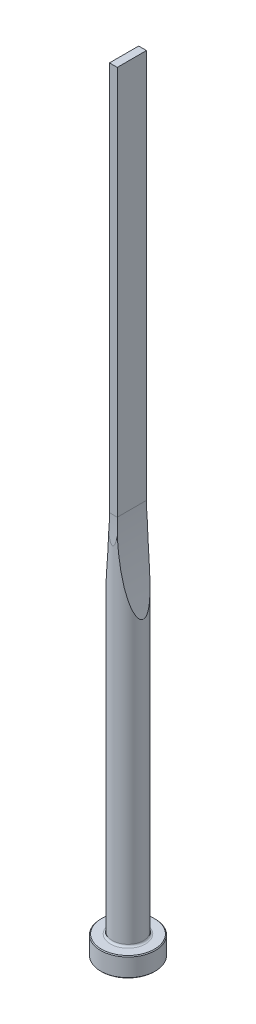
ISO-10303-21;
HEADER;
FILE_DESCRIPTION(('STEP AP214'),'2;1');
FILE_NAME('part.step','',(''),(''),'','','');
FILE_SCHEMA(('AUTOMOTIVE_DESIGN { 1 0 10303 214 1 1 1 1 }'));
ENDSEC;
DATA;
#1=APPLICATION_CONTEXT('core data for automotive mechanical design processes');
#2=APPLICATION_PROTOCOL_DEFINITION('international standard','automotive_design',2000,#1);
#3=PRODUCT_CONTEXT('',#1,'mechanical');
#4=PRODUCT('Part','Part','',(#3));
#5=PRODUCT_RELATED_PRODUCT_CATEGORY('part','',(#4));
#6=PRODUCT_DEFINITION_FORMATION('','',#4);
#7=PRODUCT_DEFINITION_CONTEXT('part definition',#1,'design');
#8=PRODUCT_DEFINITION('design','',#6,#7);
#9=PRODUCT_DEFINITION_SHAPE('','',#8);
#10=(LENGTH_UNIT() NAMED_UNIT(*) SI_UNIT(.MILLI.,.METRE.));
#11=(NAMED_UNIT(*) PLANE_ANGLE_UNIT() SI_UNIT($,.RADIAN.));
#12=(NAMED_UNIT(*) SI_UNIT($,.STERADIAN.) SOLID_ANGLE_UNIT());
#13=UNCERTAINTY_MEASURE_WITH_UNIT(LENGTH_MEASURE(1.E-05),#10,'distance_accuracy_value','');
#14=(GEOMETRIC_REPRESENTATION_CONTEXT(3) GLOBAL_UNCERTAINTY_ASSIGNED_CONTEXT((#13)) GLOBAL_UNIT_ASSIGNED_CONTEXT((#10,
#11,#12)) REPRESENTATION_CONTEXT('',''));
#15=CARTESIAN_POINT('',(0.,0.,0.));
#16=DIRECTION('',(0.,0.,1.));
#17=DIRECTION('',(1.,0.,0.));
#18=AXIS2_PLACEMENT_3D('',#15,#16,#17);
#19=CARTESIAN_POINT('',(0.,0.,0.));
#20=DIRECTION('',(0.,1.,0.));
#21=DIRECTION('',(-1.,0.,0.));
#22=AXIS2_PLACEMENT_3D('',#19,#20,#21);
#23=PLANE('',#22);
#24=CARTESIAN_POINT('',(0.,0.,0.));
#25=DIRECTION('',(0.,1.,0.));
#26=DIRECTION('',(-1.,0.,0.));
#27=AXIS2_PLACEMENT_3D('',#24,#25,#26);
#28=CIRCLE('',#27,6.8);
#29=CARTESIAN_POINT('',(-6.8,0.,0.));
#30=VERTEX_POINT('',#29);
#31=EDGE_CURVE('E133',#30,#30,#28,.T.);
#32=ORIENTED_EDGE('',*,*,#31,.F.);
#33=EDGE_LOOP('',(#32));
#34=FACE_BOUND('',#33,.T.);
#35=ADVANCED_FACE('F32',(#34),#23,.F.);
#36=CARTESIAN_POINT('',(0.,0.,0.));
#37=DIRECTION('',(0.,1.,0.));
#38=DIRECTION('',(-1.,0.,0.));
#39=AXIS2_PLACEMENT_3D('',#36,#37,#38);
#40=CONICAL_SURFACE('',#39,6.8,0.785398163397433);
#41=CARTESIAN_POINT('',(0.,0.200000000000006,0.));
#42=DIRECTION('',(0.,1.,0.));
#43=DIRECTION('',(-1.,0.,0.));
#44=AXIS2_PLACEMENT_3D('',#41,#42,#43);
#45=CIRCLE('',#44,7.);
#46=CARTESIAN_POINT('',(-7.,0.200000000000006,0.));
#47=VERTEX_POINT('',#46);
#48=EDGE_CURVE('E130',#47,#47,#45,.T.);
#49=ORIENTED_EDGE('',*,*,#48,.F.);
#50=EDGE_LOOP('',(#49));
#51=FACE_BOUND('',#50,.T.);
#52=ORIENTED_EDGE('',*,*,#31,.T.);
#53=EDGE_LOOP('',(#52));
#54=FACE_BOUND('',#53,.T.);
#55=ADVANCED_FACE('F171',(#51,#54),#40,.T.);
#56=CARTESIAN_POINT('',(0.,200.,0.));
#57=DIRECTION('',(0.,1.,0.));
#58=DIRECTION('',(-1.,0.,0.));
#59=AXIS2_PLACEMENT_3D('',#56,#57,#58);
#60=CYLINDRICAL_SURFACE('',#59,7.);
#61=CARTESIAN_POINT('',(0.,4.8,0.));
#62=DIRECTION('',(0.,1.,0.));
#63=DIRECTION('',(-1.,0.,0.));
#64=AXIS2_PLACEMENT_3D('',#61,#62,#63);
#65=CIRCLE('',#64,7.);
#66=CARTESIAN_POINT('',(-7.,4.8,0.));
#67=VERTEX_POINT('',#66);
#68=EDGE_CURVE('E127',#67,#67,#65,.T.);
#69=ORIENTED_EDGE('',*,*,#68,.F.);
#70=EDGE_LOOP('',(#69));
#71=FACE_BOUND('',#70,.T.);
#72=ORIENTED_EDGE('',*,*,#48,.T.);
#73=EDGE_LOOP('',(#72));
#74=FACE_BOUND('',#73,.T.);
#75=ADVANCED_FACE('F176',(#71,#74),#60,.T.);
#76=CARTESIAN_POINT('',(0.,4.8,0.));
#77=DIRECTION('',(0.,-1.,0.));
#78=DIRECTION('',(1.,0.,0.));
#79=AXIS2_PLACEMENT_3D('',#76,#77,#78);
#80=CONICAL_SURFACE('',#79,7.,0.785398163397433);
#81=CARTESIAN_POINT('',(0.,5.,0.));
#82=DIRECTION('',(0.,1.,0.));
#83=DIRECTION('',(-1.,0.,0.));
#84=AXIS2_PLACEMENT_3D('',#81,#82,#83);
#85=CIRCLE('',#84,6.8);
#86=CARTESIAN_POINT('',(-6.8,5.,0.));
#87=VERTEX_POINT('',#86);
#88=EDGE_CURVE('E124',#87,#87,#85,.T.);
#89=ORIENTED_EDGE('',*,*,#88,.F.);
#90=EDGE_LOOP('',(#89));
#91=FACE_BOUND('',#90,.T.);
#92=ORIENTED_EDGE('',*,*,#68,.T.);
#93=EDGE_LOOP('',(#92));
#94=FACE_BOUND('',#93,.T.);
#95=ADVANCED_FACE('F183',(#91,#94),#80,.T.);
#96=CARTESIAN_POINT('',(6.8,5.,0.));
#97=DIRECTION('',(0.,-1.,0.));
#98=DIRECTION('',(1.,0.,0.));
#99=AXIS2_PLACEMENT_3D('',#96,#97,#98);
#100=PLANE('',#99);
#101=CARTESIAN_POINT('',(0.,5.,0.));
#102=DIRECTION('',(0.,1.,0.));
#103=DIRECTION('',(-1.,0.,0.));
#104=AXIS2_PLACEMENT_3D('',#101,#102,#103);
#105=CIRCLE('',#104,4.50000000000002);
#106=CARTESIAN_POINT('',(-4.50000000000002,5.,0.));
#107=VERTEX_POINT('',#106);
#108=EDGE_CURVE('E121',#107,#107,#105,.T.);
#109=ORIENTED_EDGE('',*,*,#108,.F.);
#110=EDGE_LOOP('',(#109));
#111=FACE_BOUND('',#110,.T.);
#112=ORIENTED_EDGE('',*,*,#88,.T.);
#113=EDGE_LOOP('',(#112));
#114=FACE_BOUND('',#113,.T.);
#115=ADVANCED_FACE('F190',(#111,#114),#100,.F.);
#116=CARTESIAN_POINT('',(0.,5.5,0.));
#117=DIRECTION('',(0.,1.,0.));
#118=DIRECTION('',(-1.,0.,0.));
#119=AXIS2_PLACEMENT_3D('',#116,#117,#118);
#120=TOROIDAL_SURFACE('',#119,4.50000000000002,0.5);
#121=CARTESIAN_POINT('',(0.,5.50000000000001,0.));
#122=DIRECTION('',(0.,1.,0.));
#123=DIRECTION('',(-1.,0.,0.));
#124=AXIS2_PLACEMENT_3D('',#121,#122,#123);
#125=CIRCLE('',#124,4.00000000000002);
#126=CARTESIAN_POINT('',(-4.00000000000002,5.50000000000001,0.));
#127=VERTEX_POINT('',#126);
#128=EDGE_CURVE('E112',#127,#127,#125,.T.);
#129=ORIENTED_EDGE('',*,*,#128,.F.);
#130=EDGE_LOOP('',(#129));
#131=FACE_BOUND('',#130,.T.);
#132=ORIENTED_EDGE('',*,*,#108,.T.);
#133=EDGE_LOOP('',(#132));
#134=FACE_BOUND('',#133,.T.);
#135=ADVANCED_FACE('F168',(#131,#134),#120,.F.);
#136=CARTESIAN_POINT('',(0.,200.,0.));
#137=DIRECTION('',(0.,1.,0.));
#138=DIRECTION('',(-1.,0.,0.));
#139=AXIS2_PLACEMENT_3D('',#136,#137,#138);
#140=CYLINDRICAL_SURFACE('',#139,4.00000000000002);
#141=CARTESIAN_POINT('',(4.00000000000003,76.9565627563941,0.));
#142=CARTESIAN_POINT('',(3.99999908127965,76.9565661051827,0.0693234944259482));
#143=CARTESIAN_POINT('',(3.99817235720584,76.9634596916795,0.138657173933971));
#144=CARTESIAN_POINT('',(3.99114244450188,76.9900264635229,0.274681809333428));
#145=CARTESIAN_POINT('',(3.98593276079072,77.0097242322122,0.341367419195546));
#146=CARTESIAN_POINT('',(3.97135064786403,77.0649796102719,0.484371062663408));
#147=CARTESIAN_POINT('',(3.96131888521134,77.1030563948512,0.559625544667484));
#148=CARTESIAN_POINT('',(3.93842891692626,77.1902462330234,0.70290556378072));
#149=CARTESIAN_POINT('',(3.92556515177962,77.2393809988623,0.77091648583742));
#150=CARTESIAN_POINT('',(3.89970776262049,77.3385484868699,0.891965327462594));
#151=CARTESIAN_POINT('',(3.88693718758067,77.3876783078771,0.945808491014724));
#152=CARTESIAN_POINT('',(3.86037428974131,77.4902589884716,1.04897593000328));
#153=CARTESIAN_POINT('',(3.84658113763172,77.543713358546,1.09829646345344));
#154=CARTESIAN_POINT('',(3.81825138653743,77.6539498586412,1.19306609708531));
#155=CARTESIAN_POINT('',(3.80371318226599,77.710739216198,1.23850622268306));
#156=CARTESIAN_POINT('',(3.77413701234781,77.8267635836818,1.32590139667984));
#157=CARTESIAN_POINT('',(3.75909921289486,77.8859977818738,1.36785758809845));
#158=CARTESIAN_POINT('',(3.72120715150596,78.0359186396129,1.4685965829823));
#159=CARTESIAN_POINT('',(3.69813627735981,78.1277838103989,1.52554064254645));
#160=CARTESIAN_POINT('',(3.65154067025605,78.314614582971,1.6339290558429));
#161=CARTESIAN_POINT('',(3.6280157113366,78.4095817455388,1.68537058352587));
#162=CARTESIAN_POINT('',(3.58069701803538,78.6019791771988,1.78370145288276));
#163=CARTESIAN_POINT('',(3.55690289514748,78.6994133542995,1.83058291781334));
#164=CARTESIAN_POINT('',(3.50923075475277,78.8960774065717,1.92038432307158));
#165=CARTESIAN_POINT('',(3.4853527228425,78.9953076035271,1.96330354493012));
#166=CARTESIAN_POINT('',(3.41352667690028,79.2960810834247,2.08735367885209));
#167=CARTESIAN_POINT('',(3.36561636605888,79.4997748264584,2.16331575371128));
#168=CARTESIAN_POINT('',(3.29428173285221,79.8079687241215,2.26924886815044));
#169=CARTESIAN_POINT('',(3.27060420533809,79.9110877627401,2.30320927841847));
#170=CARTESIAN_POINT('',(3.22345187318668,80.118127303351,2.36875344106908));
#171=CARTESIAN_POINT('',(3.199977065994,80.2220477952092,2.40033722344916));
#172=CARTESIAN_POINT('',(3.1322258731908,80.5244895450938,2.48887679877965));
#173=CARTESIAN_POINT('',(3.088261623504,80.7238941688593,2.54305671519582));
#174=CARTESIAN_POINT('',(3.00136468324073,81.1245602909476,2.64505001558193));
#175=CARTESIAN_POINT('',(2.95843214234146,81.3258220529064,2.69286248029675));
#176=CARTESIAN_POINT('',(2.87369595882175,81.7298832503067,2.78311065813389));
#177=CARTESIAN_POINT('',(2.83189286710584,81.9326833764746,2.82554378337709));
#178=CARTESIAN_POINT('',(2.74951474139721,82.3394527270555,2.90576401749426));
#179=CARTESIAN_POINT('',(2.70893977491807,82.5434220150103,2.94355087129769));
#180=CARTESIAN_POINT('',(2.58896832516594,83.1576796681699,3.05104054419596));
#181=CARTESIAN_POINT('',(2.51151492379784,83.5694143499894,3.11467696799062));
#182=CARTESIAN_POINT('',(2.36211591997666,84.3954588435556,3.22943230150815));
#183=CARTESIAN_POINT('',(2.29016893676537,84.8097679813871,3.28055435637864));
#184=CARTESIAN_POINT('',(2.15175693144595,85.6414535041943,3.37296310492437));
#185=CARTESIAN_POINT('',(2.08530598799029,86.0588349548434,3.41422502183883));
#186=CARTESIAN_POINT('',(1.95819345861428,86.8952058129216,3.48868104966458));
#187=CARTESIAN_POINT('',(1.89753217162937,87.3141953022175,3.52187474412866));
#188=CARTESIAN_POINT('',(1.78214714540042,88.1529036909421,3.58164270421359));
#189=CARTESIAN_POINT('',(1.72741586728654,88.5726209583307,3.60822543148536));
#190=CARTESIAN_POINT('',(1.62384822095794,89.413084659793,3.65600398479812));
#191=CARTESIAN_POINT('',(1.57501187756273,89.8338310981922,3.6771997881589));
#192=CARTESIAN_POINT('',(1.47580213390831,90.7446966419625,3.71824477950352));
#193=CARTESIAN_POINT('',(1.4264715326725,91.2349644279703,3.73731372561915));
#194=CARTESIAN_POINT('',(1.33585613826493,92.2164157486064,3.77065176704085));
#195=CARTESIAN_POINT('',(1.29457158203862,92.7075993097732,3.78492072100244));
#196=CARTESIAN_POINT('',(1.22006810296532,93.6907304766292,3.80958961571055));
#197=CARTESIAN_POINT('',(1.1868501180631,94.182678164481,3.819989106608));
#198=CARTESIAN_POINT('',(1.12850115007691,95.1671100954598,3.83763118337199));
#199=CARTESIAN_POINT('',(1.10337020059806,95.6595943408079,3.84487375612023));
#200=CARTESIAN_POINT('',(1.06117886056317,96.6455641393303,3.85673174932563));
#201=CARTESIAN_POINT('',(1.04412872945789,97.1390501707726,3.86134383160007));
#202=CARTESIAN_POINT('',(1.01815247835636,98.1262528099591,3.86827428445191));
#203=CARTESIAN_POINT('',(1.00922637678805,98.6199694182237,3.87059264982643));
#204=CARTESIAN_POINT('',(0.999501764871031,99.6074463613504,3.87311520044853));
#205=CARTESIAN_POINT('',(0.998702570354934,100.101206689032,3.8733195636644));
#206=CARTESIAN_POINT('',(1.00523032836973,101.088679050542,3.87163059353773));
#207=CARTESIAN_POINT('',(1.0125574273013,101.58239108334,3.86973722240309));
#208=CARTESIAN_POINT('',(1.03528419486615,102.567392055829,3.86371897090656));
#209=CARTESIAN_POINT('',(1.05064737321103,103.058681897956,3.8596041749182));
#210=CARTESIAN_POINT('',(1.08941871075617,104.040907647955,3.84884036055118));
#211=CARTESIAN_POINT('',(1.11282671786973,104.531843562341,3.84219139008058));
#212=CARTESIAN_POINT('',(1.16768273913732,105.513290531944,3.82587724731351));
#213=CARTESIAN_POINT('',(1.19913195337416,106.00380151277,3.81621162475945));
#214=CARTESIAN_POINT('',(1.27005463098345,106.984155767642,3.79319818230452));
#215=CARTESIAN_POINT('',(1.30952805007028,107.473999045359,3.77985038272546));
#216=CARTESIAN_POINT('',(1.3964187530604,108.45215832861,3.74861904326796));
#217=CARTESIAN_POINT('',(1.44382502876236,108.940475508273,3.73074177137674));
#218=CARTESIAN_POINT('',(1.54658814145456,109.916030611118,3.68932757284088));
#219=CARTESIAN_POINT('',(1.60194486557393,110.40326854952,3.66579072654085));
#220=CARTESIAN_POINT('',(1.72054689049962,111.376264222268,3.61164347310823));
#221=CARTESIAN_POINT('',(1.78379011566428,111.862022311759,3.58103492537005));
#222=CARTESIAN_POINT('',(1.91810188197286,112.831796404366,3.51093205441));
#223=CARTESIAN_POINT('',(1.98916982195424,113.315812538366,3.47143841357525));
#224=CARTESIAN_POINT('',(2.1012253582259,114.038039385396,3.40392660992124));
#225=CARTESIAN_POINT('',(2.13930667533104,114.277104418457,3.38016662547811));
#226=CARTESIAN_POINT('',(2.21734164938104,114.754595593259,3.32949919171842));
#227=CARTESIAN_POINT('',(2.25729529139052,114.993021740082,3.30259176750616));
#228=CARTESIAN_POINT('',(2.33906610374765,115.469233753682,3.24519121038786));
#229=CARTESIAN_POINT('',(2.38088409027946,115.707019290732,3.21469649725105));
#230=CARTESIAN_POINT('',(2.46633098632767,116.181705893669,3.14961854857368));
#231=CARTESIAN_POINT('',(2.50995988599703,116.418606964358,3.11503533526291));
#232=CARTESIAN_POINT('',(2.59920106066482,116.892518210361,3.0409759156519));
#233=CARTESIAN_POINT('',(2.64482209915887,117.129523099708,3.00147629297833));
#234=CARTESIAN_POINT('',(2.73777477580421,117.602204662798,2.91693995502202));
#235=CARTESIAN_POINT('',(2.78510635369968,117.837881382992,2.87190343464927));
#236=CARTESIAN_POINT('',(2.88134423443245,118.307372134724,2.77533816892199));
#237=CARTESIAN_POINT('',(2.93024917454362,118.54118757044,2.72381493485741));
#238=CARTESIAN_POINT('',(3.02952417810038,119.006629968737,2.61295390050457));
#239=CARTESIAN_POINT('',(3.07989403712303,119.238257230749,2.55361718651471));
#240=CARTESIAN_POINT('',(3.18241500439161,119.700977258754,2.42468436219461));
#241=CARTESIAN_POINT('',(3.23457918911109,119.932039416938,2.35498797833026));
#242=CARTESIAN_POINT('',(3.33990650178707,120.390273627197,2.20309693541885));
#243=CARTESIAN_POINT('',(3.39307093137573,120.617439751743,2.12088483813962));
#244=CARTESIAN_POINT('',(3.47273982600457,120.952130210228,1.98563598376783));
#245=CARTESIAN_POINT('',(3.49916049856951,121.062186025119,1.93880953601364));
#246=CARTESIAN_POINT('',(3.5519150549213,121.280154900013,1.840387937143));
#247=CARTESIAN_POINT('',(3.57824895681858,121.388068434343,1.7887938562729));
#248=CARTESIAN_POINT('',(3.63057497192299,121.600822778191,1.68004710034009));
#249=CARTESIAN_POINT('',(3.65656774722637,121.705670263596,1.62290788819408));
#250=CARTESIAN_POINT('',(3.70796358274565,121.911448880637,1.50178061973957));
#251=CARTESIAN_POINT('',(3.73336706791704,122.012382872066,1.43779769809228));
#252=CARTESIAN_POINT('',(3.76958048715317,122.155271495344,1.33841469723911));
#253=CARTESIAN_POINT('',(3.7808171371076,122.199462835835,1.3063826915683));
#254=CARTESIAN_POINT('',(3.80299560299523,122.286418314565,1.24033761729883));
#255=CARTESIAN_POINT('',(3.81393737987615,122.32918226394,1.20632428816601));
#256=CARTESIAN_POINT('',(3.84622039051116,122.454980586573,1.10091663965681));
#257=CARTESIAN_POINT('',(3.86700644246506,122.535470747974,1.02618898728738));
#258=CARTESIAN_POINT('',(3.90290257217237,122.673771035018,0.878722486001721));
#259=CARTESIAN_POINT('',(3.91838915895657,122.733150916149,0.807567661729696));
#260=CARTESIAN_POINT('',(3.94649013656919,122.840522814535,0.656561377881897));
#261=CARTESIAN_POINT('',(3.95911214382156,122.888545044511,0.576733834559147));
#262=CARTESIAN_POINT('',(3.97654860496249,122.954731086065,0.436218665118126));
#263=CARTESIAN_POINT('',(3.98256540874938,122.97751993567,0.377882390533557));
#264=CARTESIAN_POINT('',(3.99211051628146,123.013637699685,0.258155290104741));
#265=CARTESIAN_POINT('',(3.99564216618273,123.026979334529,0.196768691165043));
#266=CARTESIAN_POINT('',(3.99983907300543,123.042831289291,0.0720803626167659));
#267=CARTESIAN_POINT('',(4.00048616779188,123.045272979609,0.00876901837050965));
#268=CARTESIAN_POINT('',(3.9987783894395,123.038824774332,-0.117242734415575));
#269=CARTESIAN_POINT('',(3.99642227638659,123.02993019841,-0.179942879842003));
#270=CARTESIAN_POINT('',(3.98928141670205,123.002935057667,-0.298132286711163));
#271=CARTESIAN_POINT('',(3.98469267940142,122.985577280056,-0.353809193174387));
#272=CARTESIAN_POINT('',(3.97359466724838,122.943523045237,-0.462072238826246));
#273=CARTESIAN_POINT('',(3.96708467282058,122.918823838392,-0.51465721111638));
#274=CARTESIAN_POINT('',(3.9472182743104,122.843283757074,-0.653780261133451));
#275=CARTESIAN_POINT('',(3.93234499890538,122.78656583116,-0.73689198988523));
#276=CARTESIAN_POINT('',(3.89976659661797,122.661719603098,-0.893454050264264));
#277=CARTESIAN_POINT('',(3.88205151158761,122.593551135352,-0.966868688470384));
#278=CARTESIAN_POINT('',(3.84515803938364,122.450810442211,-1.10441932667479));
#279=CARTESIAN_POINT('',(3.82600386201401,122.376342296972,-1.16867176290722));
#280=CARTESIAN_POINT('',(3.7866300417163,122.222385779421,-1.29055678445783));
#281=CARTESIAN_POINT('',(3.76640931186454,122.142892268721,-1.34818241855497));
#282=CARTESIAN_POINT('',(3.72527346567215,121.980199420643,-1.45800523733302));
#283=CARTESIAN_POINT('',(3.70435700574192,121.896992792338,-1.51019100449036));
#284=CARTESIAN_POINT('',(3.66213788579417,121.727987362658,-1.60986556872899));
#285=CARTESIAN_POINT('',(3.64083541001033,121.642189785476,-1.65735654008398));
#286=CARTESIAN_POINT('',(3.58333461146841,121.409093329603,-1.77958680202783));
#287=CARTESIAN_POINT('',(3.54693304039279,121.259943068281,-1.85069466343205));
#288=CARTESIAN_POINT('',(3.47402617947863,120.957769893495,-1.98416277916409));
#289=CARTESIAN_POINT('',(3.43752084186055,120.804744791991,-2.04651795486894));
#290=CARTESIAN_POINT('',(3.36465781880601,120.495659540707,-2.16422609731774));
#291=CARTESIAN_POINT('',(3.32830054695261,120.339594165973,-2.219565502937));
#292=CARTESIAN_POINT('',(3.25599936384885,120.025392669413,-2.32433091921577));
#293=CARTESIAN_POINT('',(3.2200555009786,119.867256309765,-2.37375624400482));
#294=CARTESIAN_POINT('',(3.14853498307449,119.548577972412,-2.46784011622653));
#295=CARTESIAN_POINT('',(3.11296114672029,119.388027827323,-2.51247298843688));
#296=CARTESIAN_POINT('',(3.04246152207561,119.065640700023,-2.59739704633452));
#297=CARTESIAN_POINT('',(3.00753576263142,118.903803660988,-2.63768803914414));
#298=CARTESIAN_POINT('',(2.93844678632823,118.579298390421,-2.71444158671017));
#299=CARTESIAN_POINT('',(2.90428263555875,118.416631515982,-2.75090905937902));
#300=CARTESIAN_POINT('',(2.83672091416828,118.090438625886,-2.82052506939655));
#301=CARTESIAN_POINT('',(2.80332332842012,117.92691262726,-2.85367367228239));
#302=CARTESIAN_POINT('',(2.70147864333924,117.421043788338,-2.95146748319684));
#303=CARTESIAN_POINT('',(2.63437939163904,117.077474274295,-3.01119821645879));
#304=CARTESIAN_POINT('',(2.50391772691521,116.388001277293,-3.1205146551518));
#305=CARTESIAN_POINT('',(2.44055587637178,116.042097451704,-3.17009883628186));
#306=CARTESIAN_POINT('',(2.31768945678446,115.348353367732,-3.26100537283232));
#307=CARTESIAN_POINT('',(2.25818681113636,115.000512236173,-3.30232362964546));
#308=CARTESIAN_POINT('',(2.14316659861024,114.30342485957,-3.37810211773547));
#309=CARTESIAN_POINT('',(2.08764916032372,113.95417856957,-3.41256212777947));
#310=CARTESIAN_POINT('',(1.98054110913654,113.253744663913,-3.47582142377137));
#311=CARTESIAN_POINT('',(1.92895986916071,112.902554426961,-3.50460744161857));
#312=CARTESIAN_POINT('',(1.82991060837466,112.199233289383,-3.55732520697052));
#313=CARTESIAN_POINT('',(1.78244263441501,111.84710237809,-3.58125689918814));
#314=CARTESIAN_POINT('',(1.64628374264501,110.789733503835,-3.64691345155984));
#315=CARTESIAN_POINT('',(1.56380501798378,110.083304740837,-3.68251817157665));
#316=CARTESIAN_POINT('',(1.41559952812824,108.668399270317,-3.74197834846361));
#317=CARTESIAN_POINT('',(1.34986900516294,107.95992305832,-3.76583644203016));
#318=CARTESIAN_POINT('',(1.23521097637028,106.541334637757,-3.80498659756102));
#319=CARTESIAN_POINT('',(1.18628456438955,105.831222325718,-3.82027810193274));
#320=CARTESIAN_POINT('',(1.10533658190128,104.410777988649,-3.844477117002));
#321=CARTESIAN_POINT('',(1.07329506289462,103.700447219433,-3.85339216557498));
#322=CARTESIAN_POINT('',(1.02605523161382,102.279204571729,-3.86624049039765));
#323=CARTESIAN_POINT('',(1.0108562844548,101.568292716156,-3.8701739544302));
#324=CARTESIAN_POINT('',(0.999328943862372,100.358226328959,-3.87315713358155));
#325=CARTESIAN_POINT('',(0.998726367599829,99.8591104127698,-3.87331302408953));
#326=CARTESIAN_POINT('',(1.00582442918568,98.8609418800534,-3.87147723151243));
#327=CARTESIAN_POINT('',(1.0135250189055,98.3618892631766,-3.86948556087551));
#328=CARTESIAN_POINT('',(1.03722967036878,97.363872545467,-3.86319865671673));
#329=CARTESIAN_POINT('',(1.05323578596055,96.8649084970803,-3.85890285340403));
#330=CARTESIAN_POINT('',(1.09354668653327,95.8673446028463,-3.84767388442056));
#331=CARTESIAN_POINT('',(1.11785146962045,95.3687447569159,-3.84074071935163));
#332=CARTESIAN_POINT('',(1.17470614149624,94.3728367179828,-3.82373444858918));
#333=CARTESIAN_POINT('',(1.20724330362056,93.8755277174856,-3.81366618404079));
#334=CARTESIAN_POINT('',(1.28056586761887,92.881612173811,-3.78967555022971));
#335=CARTESIAN_POINT('',(1.32135121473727,92.3850056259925,-3.77575320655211));
#336=CARTESIAN_POINT('',(1.41113931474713,91.3927858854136,-3.74312274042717));
#337=CARTESIAN_POINT('',(1.4601405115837,90.8971725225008,-3.72441552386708));
#338=CARTESIAN_POINT('',(1.56633082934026,89.9070977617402,-3.68101972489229));
#339=CARTESIAN_POINT('',(1.62351961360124,89.4126363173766,-3.65633138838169));
#340=CARTESIAN_POINT('',(1.72671298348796,88.5808823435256,-3.60840561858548));
#341=CARTESIAN_POINT('',(1.77055626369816,88.2432052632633,-3.58716639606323));
#342=CARTESIAN_POINT('',(1.86203181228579,87.5686496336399,-3.5405473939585));
#343=CARTESIAN_POINT('',(1.90966405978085,87.2317710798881,-3.5151676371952));
#344=CARTESIAN_POINT('',(2.00868306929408,86.5589765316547,-3.45954065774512));
#345=CARTESIAN_POINT('',(2.06006968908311,86.2230605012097,-3.42929361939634));
#346=CARTESIAN_POINT('',(2.16654882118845,85.5523963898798,-3.36303263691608));
#347=CARTESIAN_POINT('',(2.22164124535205,85.2176482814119,-3.32701882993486));
#348=CARTESIAN_POINT('',(2.35670095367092,84.4249595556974,-3.23342990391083));
#349=CARTESIAN_POINT('',(2.43828227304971,83.9676361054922,-3.17282276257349));
#350=CARTESIAN_POINT('',(2.56559466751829,83.2844482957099,-3.06931357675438));
#351=CARTESIAN_POINT('',(2.60885994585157,83.0571634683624,-3.03270663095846));
#352=CARTESIAN_POINT('',(2.69697844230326,82.6037443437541,-2.95461990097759));
#353=CARTESIAN_POINT('',(2.74183160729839,82.3776100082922,-2.91314027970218));
#354=CARTESIAN_POINT('',(2.85075538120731,81.8392572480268,-2.80731366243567));
#355=CARTESIAN_POINT('',(2.91552855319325,81.5276895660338,-2.74033948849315));
#356=CARTESIAN_POINT('',(3.04764143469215,80.9085715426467,-2.59263375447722));
#357=CARTESIAN_POINT('',(3.1149790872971,80.6010182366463,-2.51191304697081));
#358=CARTESIAN_POINT('',(3.2313494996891,80.0823657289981,-2.35894677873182));
#359=CARTESIAN_POINT('',(3.27986780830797,79.8697932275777,-2.2913247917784));
#360=CARTESIAN_POINT('',(3.37766837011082,79.4482650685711,-2.14457559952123));
#361=CARTESIAN_POINT('',(3.42695189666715,79.2393170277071,-2.06542683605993));
#362=CARTESIAN_POINT('',(3.50323968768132,78.9208540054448,-1.93138787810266));
#363=CARTESIAN_POINT('',(3.53023270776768,78.8091350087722,-1.88173006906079));
#364=CARTESIAN_POINT('',(3.58405466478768,78.5881946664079,-1.77708328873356));
#365=CARTESIAN_POINT('',(3.61088364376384,78.4789726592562,-1.72209575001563));
#366=CARTESIAN_POINT('',(3.66405248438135,78.2642122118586,-1.60586223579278));
#367=CARTESIAN_POINT('',(3.69039359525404,78.1586634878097,-1.54463600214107));
#368=CARTESIAN_POINT('',(3.74226306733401,77.9523556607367,-1.41435283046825));
#369=CARTESIAN_POINT('',(3.7677921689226,77.851592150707,-1.34530330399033));
#370=CARTESIAN_POINT('',(3.81202336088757,77.67819629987,-1.21334596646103));
#371=CARTESIAN_POINT('',(3.8310066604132,77.6041974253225,-1.15234628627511));
#372=CARTESIAN_POINT('',(3.86759286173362,77.4622762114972,-1.02286989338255));
#373=CARTESIAN_POINT('',(3.88519303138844,77.3943658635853,-0.954378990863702));
#374=CARTESIAN_POINT('',(3.91836097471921,77.2669287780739,-0.807593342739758));
#375=CARTESIAN_POINT('',(3.93389645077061,77.2075343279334,-0.729173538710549));
#376=CARTESIAN_POINT('',(3.96115450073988,77.1036627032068,-0.562403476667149));
#377=CARTESIAN_POINT('',(3.97289362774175,77.0591207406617,-0.47409865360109));
#378=CARTESIAN_POINT('',(3.98760341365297,77.003405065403,-0.320570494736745));
#379=CARTESIAN_POINT('',(3.99219982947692,76.9860292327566,-0.257781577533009));
#380=CARTESIAN_POINT('',(3.9983964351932,76.962614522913,-0.129995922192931));
#381=CARTESIAN_POINT('',(4.00000086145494,76.9565596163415,-0.065002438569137));
#382=CARTESIAN_POINT('',(4.00000000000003,76.9565627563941,0.));
#383=B_SPLINE_CURVE_WITH_KNOTS('',3,(#141,#142,#143,#144,#145,#146,#147,#148,#149,#150,#151,
#152,#153,#154,#155,#156,#157,#158,#159,#160,#161,#162,#163,#164,#165,#166,#167,#168,#169,#170,
#171,#172,#173,#174,#175,#176,#177,#178,#179,#180,#181,#182,#183,#184,#185,#186,#187,#188,#189,
#190,#191,#192,#193,#194,#195,#196,#197,#198,#199,#200,#201,#202,#203,#204,#205,#206,#207,#208,
#209,#210,#211,#212,#213,#214,#215,#216,#217,#218,#219,#220,#221,#222,#223,#224,#225,#226,#227,
#228,#229,#230,#231,#232,#233,#234,#235,#236,#237,#238,#239,#240,#241,#242,#243,#244,#245,#246,
#247,#248,#249,#250,#251,#252,#253,#254,#255,#256,#257,#258,#259,#260,#261,#262,#263,#264,#265,
#266,#267,#268,#269,#270,#271,#272,#273,#274,#275,#276,#277,#278,#279,#280,#281,#282,#283,#284,
#285,#286,#287,#288,#289,#290,#291,#292,#293,#294,#295,#296,#297,#298,#299,#300,#301,#302,#303,
#304,#305,#306,#307,#308,#309,#310,#311,#312,#313,#314,#315,#316,#317,#318,#319,#320,#321,#322,
#323,#324,#325,#326,#327,#328,#329,#330,#331,#332,#333,#334,#335,#336,#337,#338,#339,#340,#341,
#342,#343,#344,#345,#346,#347,#348,#349,#350,#351,#352,#353,#354,#355,#356,#357,#358,#359,#360,
#361,#362,#363,#364,#365,#366,#367,#368,#369,#370,#371,#372,#373,#374,#375,#376,#377,#378,#379,
#380,#381,#382),.UNSPECIFIED.,.T.,.F.,(4,2,2,2,2,2,2,2,2,2,2,2,2,2,2,2,2,2,2,2,2,2,2,2,2,2,2,2,
2,2,2,2,2,2,2,2,2,2,2,2,2,2,2,2,2,2,2,2,2,2,2,2,2,2,2,2,2,2,2,2,2,2,2,2,2,2,2,2,2,2,2,2,2,2,2,2,
2,2,2,2,2,2,2,2,2,2,2,2,2,2,2,2,2,2,2,2,2,2,2,2,2,2,2,2,2,2,2,2,2,2,2,2,2,2,2,2,2,2,2,2,4),(0.,
0.20765471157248,0.415709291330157,0.669058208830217,0.922908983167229,1.14458973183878,
1.36645227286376,1.58881477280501,1.81110402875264,2.14240740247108,2.47388012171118,
2.80591559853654,3.13801116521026,3.80539132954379,4.13873386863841,4.47207219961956,
5.10570938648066,5.73943795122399,6.37347024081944,7.00753732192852,8.27850002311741,
9.54914297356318,10.8229460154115,12.0968147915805,13.3690446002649,14.6412797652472,
16.1205179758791,17.5997997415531,19.0792534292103,20.5587132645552,22.0400464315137,
23.521382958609,25.0025947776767,26.4838332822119,27.9584034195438,29.432945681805,
30.9077081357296,32.382462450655,33.8551870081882,35.327890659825,36.8002075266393,
38.2724113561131,39.0021153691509,39.7318135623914,40.4618344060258,41.1918512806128,
41.9254887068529,42.6591003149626,43.3920927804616,44.1249834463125,44.8654956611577,
45.6070492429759,45.9744252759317,46.3417190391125,46.7081423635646,47.0742926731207,
47.2414153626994,47.4085600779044,47.7430365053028,48.0241616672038,48.3045303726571,
48.492592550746,48.6804010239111,48.8693903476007,49.0584577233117,49.2333036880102,
49.4082152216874,49.7115824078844,50.0160368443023,50.3161898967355,50.6166549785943,
50.9177385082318,51.2186819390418,51.7258716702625,52.2333544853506,52.7418037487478,
53.2503119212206,53.7614211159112,54.2725530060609,54.7830191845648,55.2934752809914,
56.3585947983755,57.4238742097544,58.4896805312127,59.5555212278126,60.6238254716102,
61.6921418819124,63.8281212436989,65.9636209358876,68.0992596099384,70.2323694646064,
72.3653989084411,73.8626801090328,75.3599526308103,76.8575955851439,78.3552381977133,
79.850579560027,81.3459109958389,82.8409595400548,84.3359466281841,85.3594253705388,
86.3828984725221,87.4063328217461,88.4297428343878,89.8348427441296,90.5375282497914,
91.2401902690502,92.2155496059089,93.1901424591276,93.8747780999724,94.560711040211,
94.9362132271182,95.3116147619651,95.6858632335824,96.0597600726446,96.3526877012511,
96.6461801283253,96.9438272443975,97.2401584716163,97.4351459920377,97.6298572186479),.UNSPECIFIED.);
#384=CARTESIAN_POINT('',(1.09671499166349,95.8287478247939,-3.84671499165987));
#385=VERTEX_POINT('',#384);
#386=CARTESIAN_POINT('',(1.09671499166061,95.8287478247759,3.84671499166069));
#387=VERTEX_POINT('',#386);
#388=EDGE_CURVE('E138',#385,#387,#383,.T.);
#389=ORIENTED_EDGE('',*,*,#388,.T.);
#390=CARTESIAN_POINT('',(-1.3919410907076,100.,3.74999999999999));
#391=CARTESIAN_POINT('',(-1.39194449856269,100.334099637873,3.75000007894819));
#392=CARTESIAN_POINT('',(-1.38695792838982,100.668209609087,3.75186098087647));
#393=CARTESIAN_POINT('',(-1.36667392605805,101.336077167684,3.75929815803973));
#394=CARTESIAN_POINT('',(-1.35137656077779,101.669834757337,3.76487440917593));
#395=CARTESIAN_POINT('',(-1.30923320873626,102.337406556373,3.7797366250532));
#396=CARTESIAN_POINT('',(-1.2823577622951,102.671218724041,3.78903204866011));
#397=CARTESIAN_POINT('',(-1.21470251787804,103.337193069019,3.81127649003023));
#398=CARTESIAN_POINT('',(-1.17393087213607,103.669356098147,3.82422336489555));
#399=CARTESIAN_POINT('',(-1.09844611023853,104.165763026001,3.84630718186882));
#400=CARTESIAN_POINT('',(-1.07085040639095,104.331144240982,3.85412453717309));
#401=CARTESIAN_POINT('',(-1.00961852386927,104.660899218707,3.87061811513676));
#402=CARTESIAN_POINT('',(-0.975977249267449,104.825272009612,3.87929505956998));
#403=CARTESIAN_POINT('',(-0.90089774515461,105.151793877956,3.89742276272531));
#404=CARTESIAN_POINT('',(-0.859480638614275,105.313947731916,3.90687138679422));
#405=CARTESIAN_POINT('',(-0.788768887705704,105.554515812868,3.92153114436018));
#406=CARTESIAN_POINT('',(-0.763786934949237,105.634208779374,3.92649537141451));
#407=CARTESIAN_POINT('',(-0.710141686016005,105.792326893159,3.93655330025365));
#408=CARTESIAN_POINT('',(-0.681479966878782,105.870752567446,3.94164694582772));
#409=CARTESIAN_POINT('',(-0.619110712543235,106.025914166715,3.95192410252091));
#410=CARTESIAN_POINT('',(-0.585384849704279,106.102642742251,3.9571078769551));
#411=CARTESIAN_POINT('',(-0.51091844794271,106.252489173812,3.96741853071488));
#412=CARTESIAN_POINT('',(-0.470205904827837,106.32561999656,3.97254555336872));
#413=CARTESIAN_POINT('',(-0.405871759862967,106.421768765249,3.97939443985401));
#414=CARTESIAN_POINT('',(-0.387100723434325,106.447990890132,3.98127456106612));
#415=CARTESIAN_POINT('',(-0.347340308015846,106.498838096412,3.98494137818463));
#416=CARTESIAN_POINT('',(-0.326345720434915,106.523459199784,3.98672783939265));
#417=CARTESIAN_POINT('',(-0.28138142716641,106.570454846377,3.99015550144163));
#418=CARTESIAN_POINT('',(-0.25737889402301,106.592798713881,3.99179469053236));
#419=CARTESIAN_POINT('',(-0.206002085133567,106.633234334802,3.99477391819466));
#420=CARTESIAN_POINT('',(-0.17864389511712,106.651345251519,3.99611530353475));
#421=CARTESIAN_POINT('',(-0.133196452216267,106.674230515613,3.99781497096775));
#422=CARTESIAN_POINT('',(-0.116315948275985,106.681368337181,3.99834625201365));
#423=CARTESIAN_POINT('',(-0.0816311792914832,106.692886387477,3.99920443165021));
#424=CARTESIAN_POINT('',(-0.0638281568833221,106.697270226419,3.99953159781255));
#425=CARTESIAN_POINT('',(-0.0275781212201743,106.702824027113,3.99994619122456));
#426=CARTESIAN_POINT('',(-0.00912739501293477,106.703970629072,4.00003187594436));
#427=CARTESIAN_POINT('',(0.0276703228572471,106.702829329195,3.99994663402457));
#428=CARTESIAN_POINT('',(0.046017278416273,106.700540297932,3.99977562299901));
#429=CARTESIAN_POINT('',(0.0805943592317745,106.693127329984,3.99922251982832));
#430=CARTESIAN_POINT('',(0.0968774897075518,106.688240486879,3.99885808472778));
#431=CARTESIAN_POINT('',(0.128581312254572,106.676235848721,3.99796430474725));
#432=CARTESIAN_POINT('',(0.144001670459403,106.669117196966,3.99743489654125));
#433=CARTESIAN_POINT('',(0.18500697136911,106.647151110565,3.99580470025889));
#434=CARTESIAN_POINT('',(0.209611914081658,106.630495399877,3.99457196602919));
#435=CARTESIAN_POINT('',(0.256071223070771,106.593720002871,3.9918627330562));
#436=CARTESIAN_POINT('',(0.277915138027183,106.573587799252,3.9903853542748));
#437=CARTESIAN_POINT('',(0.350665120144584,106.499085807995,3.98494736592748));
#438=CARTESIAN_POINT('',(0.39555281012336,106.438989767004,3.98061079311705));
#439=CARTESIAN_POINT('',(0.476792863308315,106.313343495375,3.97168524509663));
#440=CARTESIAN_POINT('',(0.513090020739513,106.247761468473,3.96709485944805));
#441=CARTESIAN_POINT('',(0.605299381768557,106.063175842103,3.95438947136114));
#442=CARTESIAN_POINT('',(0.655314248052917,105.941243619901,3.94623160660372));
#443=CARTESIAN_POINT('',(0.745376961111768,105.693666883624,3.93019294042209));
#444=CARTESIAN_POINT('',(0.785397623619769,105.568013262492,3.92231294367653));
#445=CARTESIAN_POINT('',(0.858576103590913,105.314360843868,3.90694950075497));
#446=CARTESIAN_POINT('',(0.891716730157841,105.186357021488,3.89946708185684));
#447=CARTESIAN_POINT('',(0.952763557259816,104.929294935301,3.88499773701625));
#448=CARTESIAN_POINT('',(0.980676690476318,104.800238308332,3.87801016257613));
#449=CARTESIAN_POINT('',(1.05809609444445,104.413067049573,3.85789047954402));
#450=CARTESIAN_POINT('',(1.10161068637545,104.153715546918,3.84552636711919));
#451=CARTESIAN_POINT('',(1.17739914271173,103.633248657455,3.82298810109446));
#452=CARTESIAN_POINT('',(1.20966805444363,103.372132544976,3.81281491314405));
#453=CARTESIAN_POINT('',(1.26533785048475,102.848421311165,3.79470411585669));
#454=CARTESIAN_POINT('',(1.28872293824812,102.585824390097,3.78677049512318));
#455=CARTESIAN_POINT('',(1.32794213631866,102.059995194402,3.77319404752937));
#456=CARTESIAN_POINT('',(1.34377550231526,101.796762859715,3.767551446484));
#457=CARTESIAN_POINT('',(1.36866096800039,101.270393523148,3.75858225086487));
#458=CARTESIAN_POINT('',(1.37772460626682,101.007257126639,3.75525171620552));
#459=CARTESIAN_POINT('',(1.3895293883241,100.480822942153,3.7508994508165));
#460=CARTESIAN_POINT('',(1.3922704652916,100.2175251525,3.74987774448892));
#461=CARTESIAN_POINT('',(1.39154941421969,99.6912325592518,3.75014538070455));
#462=CARTESIAN_POINT('',(1.38809419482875,99.4282377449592,3.75143214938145));
#463=CARTESIAN_POINT('',(1.37484398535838,98.9024375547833,3.75630869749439));
#464=CARTESIAN_POINT('',(1.36504925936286,98.6396321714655,3.75989838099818));
#465=CARTESIAN_POINT('',(1.33880225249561,98.1170444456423,3.76932382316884));
#466=CARTESIAN_POINT('',(1.32241801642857,97.8572583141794,3.77513659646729));
#467=CARTESIAN_POINT('',(1.2821739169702,97.3382024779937,3.78899593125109));
#468=CARTESIAN_POINT('',(1.25831091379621,97.0789330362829,3.79704343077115));
#469=CARTESIAN_POINT('',(1.20163024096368,96.5608244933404,3.81536023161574));
#470=CARTESIAN_POINT('',(1.16879164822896,96.3019878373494,3.82563471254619));
#471=CARTESIAN_POINT('',(1.09180587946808,95.7862363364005,3.84832767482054));
#472=CARTESIAN_POINT('',(1.04766828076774,95.529320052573,3.8607443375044));
#473=CARTESIAN_POINT('',(0.969147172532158,95.1457963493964,3.88091053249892));
#474=CARTESIAN_POINT('',(0.940826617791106,95.0179166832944,3.88791072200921));
#475=CARTESIAN_POINT('',(0.878848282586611,94.7632801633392,3.90238986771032));
#476=CARTESIAN_POINT('',(0.845183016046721,94.6365251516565,3.90986948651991));
#477=CARTESIAN_POINT('',(0.770839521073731,94.3854811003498,3.92521002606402));
#478=CARTESIAN_POINT('',(0.730184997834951,94.2611852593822,3.93306959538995));
#479=CARTESIAN_POINT('',(0.661250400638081,94.0778844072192,3.94503185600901));
#480=CARTESIAN_POINT('',(0.636977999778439,94.0173732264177,3.94904355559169));
#481=CARTESIAN_POINT('',(0.584962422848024,93.8978769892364,3.95708454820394));
#482=CARTESIAN_POINT('',(0.557221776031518,93.8388908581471,3.96111382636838));
#483=CARTESIAN_POINT('',(0.496796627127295,93.7229032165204,3.96914753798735));
#484=CARTESIAN_POINT('',(0.464075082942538,93.6659208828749,3.97315152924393));
#485=CARTESIAN_POINT('',(0.391808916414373,93.5565882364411,3.98093309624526));
#486=CARTESIAN_POINT('',(0.352311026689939,93.5042096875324,3.98471199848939));
#487=CARTESIAN_POINT('',(0.291384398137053,93.4398387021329,3.98940404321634));
#488=CARTESIAN_POINT('',(0.274626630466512,93.4235001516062,3.99059997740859));
#489=CARTESIAN_POINT('',(0.23943399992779,93.3926348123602,3.99286679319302));
#490=CARTESIAN_POINT('',(0.220996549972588,93.3781109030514,3.99393747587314));
#491=CARTESIAN_POINT('',(0.182038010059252,93.3515121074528,3.99590377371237));
#492=CARTESIAN_POINT('',(0.161493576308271,93.3394704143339,3.99679701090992));
#493=CARTESIAN_POINT('',(0.118575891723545,93.3192603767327,3.99829905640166));
#494=CARTESIAN_POINT('',(0.0962092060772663,93.3110787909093,3.99890883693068));
#495=CARTESIAN_POINT('',(0.056541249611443,93.3013407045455,3.99963520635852));
#496=CARTESIAN_POINT('',(0.0395386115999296,93.2985809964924,3.99984131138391));
#497=CARTESIAN_POINT('',(0.00530985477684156,93.2960145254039,4.00003297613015));
#498=CARTESIAN_POINT('',(-0.0119161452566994,93.2962062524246,4.00001864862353));
#499=CARTESIAN_POINT('',(-0.0460423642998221,93.299517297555,3.99977139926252));
#500=CARTESIAN_POINT('',(-0.0629431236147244,93.3026312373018,3.99953887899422));
#501=CARTESIAN_POINT('',(-0.0960472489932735,93.3114519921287,3.99888109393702));
#502=CARTESIAN_POINT('',(-0.112249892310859,93.3171614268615,3.99845563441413));
#503=CARTESIAN_POINT('',(-0.151566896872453,93.3340811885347,3.99719710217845));
#504=CARTESIAN_POINT('',(-0.174103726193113,93.3466149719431,3.99626655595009));
#505=CARTESIAN_POINT('',(-0.216979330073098,93.3749765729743,3.99416860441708));
#506=CARTESIAN_POINT('',(-0.237311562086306,93.3908138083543,3.99300052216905));
#507=CARTESIAN_POINT('',(-0.29316404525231,93.4396828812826,3.98941150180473));
#508=CARTESIAN_POINT('',(-0.326182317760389,93.4755180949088,3.98679738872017));
#509=CARTESIAN_POINT('',(-0.387204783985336,93.5511526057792,3.98133154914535));
#510=CARTESIAN_POINT('',(-0.415192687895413,93.5909641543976,3.9784790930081));
#511=CARTESIAN_POINT('',(-0.485402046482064,93.7007934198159,3.97068874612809));
#512=CARTESIAN_POINT('',(-0.524314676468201,93.7728961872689,3.96565520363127));
#513=CARTESIAN_POINT('',(-0.595699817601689,93.9202694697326,3.95555476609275));
#514=CARTESIAN_POINT('',(-0.628155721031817,93.9955475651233,3.95048781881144));
#515=CARTESIAN_POINT('',(-0.688605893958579,94.1483373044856,3.9404017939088));
#516=CARTESIAN_POINT('',(-0.716575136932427,94.2258588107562,3.93538312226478));
#517=CARTESIAN_POINT('',(-0.768950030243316,94.3819705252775,3.92548292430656));
#518=CARTESIAN_POINT('',(-0.793360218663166,94.4605592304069,3.92060122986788));
#519=CARTESIAN_POINT('',(-0.867663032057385,94.7152944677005,3.90511794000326));
#520=CARTESIAN_POINT('',(-0.912146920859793,94.8930332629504,3.89483400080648));
#521=CARTESIAN_POINT('',(-0.992112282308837,95.250606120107,3.87522370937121));
#522=CARTESIAN_POINT('',(-1.02758760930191,95.4304415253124,3.86589801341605));
#523=CARTESIAN_POINT('',(-1.09180429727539,95.791761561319,3.84825637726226));
#524=CARTESIAN_POINT('',(-1.1205306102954,95.9732489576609,3.8399427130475));
#525=CARTESIAN_POINT('',(-1.1725161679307,96.3370581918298,3.82438612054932));
#526=CARTESIAN_POINT('',(-1.19577469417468,96.5193801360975,3.81714333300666));
#527=CARTESIAN_POINT('',(-1.25866381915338,97.0667778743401,3.79707123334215));
#528=CARTESIAN_POINT('',(-1.29147691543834,97.4327013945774,3.78587783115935));
#529=CARTESIAN_POINT('',(-1.34282300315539,98.165177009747,3.76795987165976));
#530=CARTESIAN_POINT('',(-1.36137252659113,98.5317278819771,3.76123014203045));
#531=CARTESIAN_POINT('',(-1.37978686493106,99.0820898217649,3.75449366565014));
#532=CARTESIAN_POINT('',(-1.38435657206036,99.2657354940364,3.75280785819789));
#533=CARTESIAN_POINT('',(-1.3904313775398,99.6329197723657,3.75056150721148));
#534=CARTESIAN_POINT('',(-1.39193921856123,99.8164583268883,3.74999995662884));
#535=CARTESIAN_POINT('',(-1.3919410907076,100.,3.74999999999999));
#536=B_SPLINE_CURVE_WITH_KNOTS('',3,(#390,#391,#392,#393,#394,#395,#396,#397,#398,#399,#400,
#401,#402,#403,#404,#405,#406,#407,#408,#409,#410,#411,#412,#413,#414,#415,#416,#417,#418,#419,
#420,#421,#422,#423,#424,#425,#426,#427,#428,#429,#430,#431,#432,#433,#434,#435,#436,#437,#438,
#439,#440,#441,#442,#443,#444,#445,#446,#447,#448,#449,#450,#451,#452,#453,#454,#455,#456,#457,
#458,#459,#460,#461,#462,#463,#464,#465,#466,#467,#468,#469,#470,#471,#472,#473,#474,#475,#476,
#477,#478,#479,#480,#481,#482,#483,#484,#485,#486,#487,#488,#489,#490,#491,#492,#493,#494,#495,
#496,#497,#498,#499,#500,#501,#502,#503,#504,#505,#506,#507,#508,#509,#510,#511,#512,#513,#514,
#515,#516,#517,#518,#519,#520,#521,#522,#523,#524,#525,#526,#527,#528,#529,#530,#531,#532,#533,
#534,#535),.UNSPECIFIED.,.T.,.F.,(4,2,2,2,2,2,2,2,2,2,2,2,2,2,2,2,2,2,2,2,2,2,2,2,2,2,2,2,2,2,2,
2,2,2,2,2,2,2,2,2,2,2,2,2,2,2,2,2,2,2,2,2,2,2,2,2,2,2,2,2,2,2,2,2,2,2,2,2,2,2,2,2,4),(0.,
1.00227413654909,2.00454177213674,3.00937481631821,4.01361938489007,4.51708131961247,
5.02096963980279,5.52350845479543,5.77444116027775,6.02526668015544,6.27702287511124,
6.52779287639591,6.62462106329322,6.72168130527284,6.81991213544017,6.91768924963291,
6.97250700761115,7.02725275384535,7.08239254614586,7.13755046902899,7.18837076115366,
7.23921058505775,7.32790198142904,7.41691964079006,7.64058495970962,7.86565080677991,
8.26074626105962,8.65690494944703,9.0540418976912,9.45064837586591,10.2400274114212,
11.0297536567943,11.8208776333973,12.6120795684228,13.401929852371,14.1917884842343,
14.9807669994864,15.7697126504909,16.5507124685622,17.3320406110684,18.1152058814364,
18.8977095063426,19.2911173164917,19.6850810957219,20.0777341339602,20.2736272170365,
20.4693782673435,20.6666634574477,20.8626390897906,20.9328478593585,21.0031666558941,
21.0743722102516,21.1453316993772,21.1967759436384,21.2481938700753,21.299517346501,
21.3508927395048,21.4278600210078,21.5050498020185,21.6506217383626,21.7966569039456,
22.0422774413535,22.2885218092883,22.5360952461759,22.7833501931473,23.333450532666,
23.8839251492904,24.4356157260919,24.9873787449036,26.0896404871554,27.1906227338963,
27.7417280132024,28.2923394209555),.UNSPECIFIED.);
#537=CARTESIAN_POINT('',(-1.09671499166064,95.8287478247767,3.84671499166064));
#538=VERTEX_POINT('',#537);
#539=EDGE_CURVE('E104',#387,#538,#536,.T.);
#540=ORIENTED_EDGE('',*,*,#539,.T.);
#541=CARTESIAN_POINT('',(-4.00000000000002,76.956562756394,0.));
#542=CARTESIAN_POINT('',(-3.99999908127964,76.9565661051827,-0.0693234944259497));
#543=CARTESIAN_POINT('',(-3.99817235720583,76.9634596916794,-0.138657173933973));
#544=CARTESIAN_POINT('',(-3.99114244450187,76.9900264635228,-0.274681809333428));
#545=CARTESIAN_POINT('',(-3.98593276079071,77.0097242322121,-0.341367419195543));
#546=CARTESIAN_POINT('',(-3.97135064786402,77.0649796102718,-0.484371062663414));
#547=CARTESIAN_POINT('',(-3.96131888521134,77.103056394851,-0.559625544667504));
#548=CARTESIAN_POINT('',(-3.93842891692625,77.1902462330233,-0.702905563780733));
#549=CARTESIAN_POINT('',(-3.92556515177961,77.2393809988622,-0.770916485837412));
#550=CARTESIAN_POINT('',(-3.89970776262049,77.3385484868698,-0.891965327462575));
#551=CARTESIAN_POINT('',(-3.88693718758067,77.387678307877,-0.945808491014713));
#552=CARTESIAN_POINT('',(-3.86037428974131,77.4902589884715,-1.04897593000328));
#553=CARTESIAN_POINT('',(-3.84658113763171,77.5437133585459,-1.09829646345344));
#554=CARTESIAN_POINT('',(-3.81825138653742,77.6539498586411,-1.19306609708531));
#555=CARTESIAN_POINT('',(-3.80371318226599,77.7107392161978,-1.23850622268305));
#556=CARTESIAN_POINT('',(-3.77413701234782,77.8267635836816,-1.32590139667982));
#557=CARTESIAN_POINT('',(-3.75909921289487,77.8859977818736,-1.36785758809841));
#558=CARTESIAN_POINT('',(-3.72120715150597,78.0359186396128,-1.46859658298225));
#559=CARTESIAN_POINT('',(-3.69813627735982,78.1277838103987,-1.52554064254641));
#560=CARTESIAN_POINT('',(-3.65154067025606,78.3146145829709,-1.63392905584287));
#561=CARTESIAN_POINT('',(-3.62801571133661,78.4095817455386,-1.68537058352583));
#562=CARTESIAN_POINT('',(-3.58069701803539,78.6019791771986,-1.78370145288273));
#563=CARTESIAN_POINT('',(-3.55690289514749,78.6994133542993,-1.8305829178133));
#564=CARTESIAN_POINT('',(-3.50923075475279,78.8960774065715,-1.92038432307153));
#565=CARTESIAN_POINT('',(-3.48535272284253,78.9953076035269,-1.96330354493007));
#566=CARTESIAN_POINT('',(-3.4135266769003,79.2960810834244,-2.08735367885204));
#567=CARTESIAN_POINT('',(-3.3656163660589,79.4997748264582,-2.16331575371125));
#568=CARTESIAN_POINT('',(-3.29428173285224,79.8079687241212,-2.26924886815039));
#569=CARTESIAN_POINT('',(-3.27060420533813,79.9110877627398,-2.30320927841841));
#570=CARTESIAN_POINT('',(-3.22345187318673,80.1181273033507,-2.36875344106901));
#571=CARTESIAN_POINT('',(-3.19997706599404,80.222047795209,-2.4003372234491));
#572=CARTESIAN_POINT('',(-3.13222587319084,80.5244895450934,-2.48887679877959));
#573=CARTESIAN_POINT('',(-3.08826162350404,80.7238941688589,-2.54305671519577));
#574=CARTESIAN_POINT('',(-3.00136468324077,81.1245602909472,-2.64505001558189));
#575=CARTESIAN_POINT('',(-2.9584321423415,81.325822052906,-2.69286248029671));
#576=CARTESIAN_POINT('',(-2.87369595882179,81.7298832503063,-2.78311065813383));
#577=CARTESIAN_POINT('',(-2.83189286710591,81.9326833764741,-2.82554378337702));
#578=CARTESIAN_POINT('',(-2.74951474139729,82.339452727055,-2.90576401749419));
#579=CARTESIAN_POINT('',(-2.70893977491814,82.5434220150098,-2.94355087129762));
#580=CARTESIAN_POINT('',(-2.58896832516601,83.1576796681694,-3.05104054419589));
#581=CARTESIAN_POINT('',(-2.51151492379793,83.5694143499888,-3.11467696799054));
#582=CARTESIAN_POINT('',(-2.36211591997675,84.395458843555,-3.22943230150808));
#583=CARTESIAN_POINT('',(-2.29016893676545,84.8097679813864,-3.28055435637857));
#584=CARTESIAN_POINT('',(-2.15175693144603,85.6414535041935,-3.37296310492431));
#585=CARTESIAN_POINT('',(-2.08530598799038,86.0588349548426,-3.41422502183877));
#586=CARTESIAN_POINT('',(-1.95819345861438,86.8952058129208,-3.48868104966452));
#587=CARTESIAN_POINT('',(-1.89753217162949,87.3141953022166,-3.5218747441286));
#588=CARTESIAN_POINT('',(-1.78214714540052,88.1529036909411,-3.58164270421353));
#589=CARTESIAN_POINT('',(-1.72741586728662,88.5726209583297,-3.60822543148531));
#590=CARTESIAN_POINT('',(-1.62384822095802,89.4130846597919,-3.65600398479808));
#591=CARTESIAN_POINT('',(-1.57501187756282,89.8338310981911,-3.67719978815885));
#592=CARTESIAN_POINT('',(-1.47580213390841,90.7446966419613,-3.71824477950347));
#593=CARTESIAN_POINT('',(-1.42647153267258,91.2349644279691,-3.73731372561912));
#594=CARTESIAN_POINT('',(-1.33585613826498,92.2164157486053,-3.77065176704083));
#595=CARTESIAN_POINT('',(-1.29457158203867,92.7075993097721,-3.78492072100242));
#596=CARTESIAN_POINT('',(-1.22006810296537,93.6907304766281,-3.80958961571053));
#597=CARTESIAN_POINT('',(-1.18685011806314,94.18267816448,-3.81998910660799));
#598=CARTESIAN_POINT('',(-1.12850115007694,95.1671100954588,-3.83763118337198));
#599=CARTESIAN_POINT('',(-1.10337020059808,95.6595943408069,-3.84487375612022));
#600=CARTESIAN_POINT('',(-1.06117886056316,96.6455641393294,-3.85673174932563));
#601=CARTESIAN_POINT('',(-1.04412872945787,97.1390501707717,-3.86134383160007));
#602=CARTESIAN_POINT('',(-1.01815247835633,98.1262528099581,-3.86827428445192));
#603=CARTESIAN_POINT('',(-1.00922637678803,98.6199694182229,-3.87059264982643));
#604=CARTESIAN_POINT('',(-0.999501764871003,99.6074463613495,-3.87311520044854));
#605=CARTESIAN_POINT('',(-0.998702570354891,100.101206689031,-3.87331956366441));
#606=CARTESIAN_POINT('',(-1.00523032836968,101.088679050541,-3.87163059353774));
#607=CARTESIAN_POINT('',(-1.01255742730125,101.58239108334,-3.8697372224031));
#608=CARTESIAN_POINT('',(-1.03528419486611,102.567392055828,-3.86371897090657));
#609=CARTESIAN_POINT('',(-1.05064737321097,103.058681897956,-3.85960417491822));
#610=CARTESIAN_POINT('',(-1.0894187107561,104.040907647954,-3.8488403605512));
#611=CARTESIAN_POINT('',(-1.11282671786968,104.53184356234,-3.84219139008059));
#612=CARTESIAN_POINT('',(-1.16768273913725,105.513290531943,-3.82587724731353));
#613=CARTESIAN_POINT('',(-1.19913195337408,106.003801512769,-3.81621162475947));
#614=CARTESIAN_POINT('',(-1.27005463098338,106.984155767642,-3.79319818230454));
#615=CARTESIAN_POINT('',(-1.30952805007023,107.473999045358,-3.77985038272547));
#616=CARTESIAN_POINT('',(-1.39641875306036,108.452158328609,-3.74861904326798));
#617=CARTESIAN_POINT('',(-1.44382502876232,108.940475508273,-3.73074177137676));
#618=CARTESIAN_POINT('',(-1.5465881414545,109.916030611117,-3.6893275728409));
#619=CARTESIAN_POINT('',(-1.60194486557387,110.403268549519,-3.66579072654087));
#620=CARTESIAN_POINT('',(-1.72054689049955,111.376264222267,-3.61164347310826));
#621=CARTESIAN_POINT('',(-1.7837901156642,111.862022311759,-3.58103492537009));
#622=CARTESIAN_POINT('',(-1.91810188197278,112.831796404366,-3.51093205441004));
#623=CARTESIAN_POINT('',(-1.98916982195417,113.315812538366,-3.47143841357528));
#624=CARTESIAN_POINT('',(-2.10122535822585,114.038039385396,-3.40392660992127));
#625=CARTESIAN_POINT('',(-2.13930667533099,114.277104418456,-3.38016662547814));
#626=CARTESIAN_POINT('',(-2.217341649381,114.754595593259,-3.32949919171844));
#627=CARTESIAN_POINT('',(-2.25729529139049,114.993021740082,-3.30259176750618));
#628=CARTESIAN_POINT('',(-2.33906610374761,115.469233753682,-3.24519121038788));
#629=CARTESIAN_POINT('',(-2.38088409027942,115.707019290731,-3.21469649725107));
#630=CARTESIAN_POINT('',(-2.46633098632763,116.181705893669,-3.14961854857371));
#631=CARTESIAN_POINT('',(-2.50995988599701,116.418606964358,-3.11503533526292));
#632=CARTESIAN_POINT('',(-2.5992010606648,116.892518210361,-3.04097591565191));
#633=CARTESIAN_POINT('',(-2.64482209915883,117.129523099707,-3.00147629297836));
#634=CARTESIAN_POINT('',(-2.73777477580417,117.602204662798,-2.91693995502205));
#635=CARTESIAN_POINT('',(-2.78510635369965,117.837881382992,-2.87190343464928));
#636=CARTESIAN_POINT('',(-2.88134423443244,118.307372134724,-2.775338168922));
#637=CARTESIAN_POINT('',(-2.93024917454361,118.54118757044,-2.72381493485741));
#638=CARTESIAN_POINT('',(-3.02952417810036,119.006629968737,-2.61295390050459));
#639=CARTESIAN_POINT('',(-3.079894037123,119.238257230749,-2.55361718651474));
#640=CARTESIAN_POINT('',(-3.18241500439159,119.700977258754,-2.42468436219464));
#641=CARTESIAN_POINT('',(-3.23457918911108,119.932039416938,-2.35498797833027));
#642=CARTESIAN_POINT('',(-3.33990650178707,120.390273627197,-2.20309693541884));
#643=CARTESIAN_POINT('',(-3.39307093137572,120.617439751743,-2.12088483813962));
#644=CARTESIAN_POINT('',(-3.47273982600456,120.952130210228,-1.98563598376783));
#645=CARTESIAN_POINT('',(-3.4991604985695,121.062186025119,-1.93880953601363));
#646=CARTESIAN_POINT('',(-3.5519150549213,121.280154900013,-1.840387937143));
#647=CARTESIAN_POINT('',(-3.57824895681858,121.388068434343,-1.78879385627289));
#648=CARTESIAN_POINT('',(-3.63057497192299,121.600822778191,-1.68004710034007));
#649=CARTESIAN_POINT('',(-3.65656774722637,121.705670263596,-1.62290788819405));
#650=CARTESIAN_POINT('',(-3.70796358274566,121.911448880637,-1.50178061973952));
#651=CARTESIAN_POINT('',(-3.73336706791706,122.012382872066,-1.43779769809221));
#652=CARTESIAN_POINT('',(-3.76958048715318,122.155271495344,-1.33841469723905));
#653=CARTESIAN_POINT('',(-3.78081713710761,122.199462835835,-1.30638269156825));
#654=CARTESIAN_POINT('',(-3.80299560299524,122.286418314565,-1.24033761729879));
#655=CARTESIAN_POINT('',(-3.81393737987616,122.32918226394,-1.20632428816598));
#656=CARTESIAN_POINT('',(-3.84622039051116,122.454980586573,-1.10091663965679));
#657=CARTESIAN_POINT('',(-3.86700644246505,122.535470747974,-1.02618898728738));
#658=CARTESIAN_POINT('',(-3.90290257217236,122.673771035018,-0.878722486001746));
#659=CARTESIAN_POINT('',(-3.91838915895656,122.733150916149,-0.807567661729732));
#660=CARTESIAN_POINT('',(-3.94649013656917,122.840522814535,-0.656561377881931));
#661=CARTESIAN_POINT('',(-3.95911214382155,122.888545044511,-0.576733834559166));
#662=CARTESIAN_POINT('',(-3.97654860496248,122.954731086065,-0.43621866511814));
#663=CARTESIAN_POINT('',(-3.98256540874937,122.97751993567,-0.377882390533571));
#664=CARTESIAN_POINT('',(-3.99211051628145,123.013637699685,-0.258155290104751));
#665=CARTESIAN_POINT('',(-3.99564216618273,123.026979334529,-0.19676869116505));
#666=CARTESIAN_POINT('',(-3.99983907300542,123.042831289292,-0.0720803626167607));
#667=CARTESIAN_POINT('',(-4.00048616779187,123.045272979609,-0.00876901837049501));
#668=CARTESIAN_POINT('',(-3.99877838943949,123.038824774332,0.117242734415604));
#669=CARTESIAN_POINT('',(-3.99642227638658,123.02993019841,0.179942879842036));
#670=CARTESIAN_POINT('',(-3.98928141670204,123.002935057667,0.298132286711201));
#671=CARTESIAN_POINT('',(-3.98469267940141,122.985577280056,0.353809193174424));
#672=CARTESIAN_POINT('',(-3.97359466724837,122.943523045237,0.462072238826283));
#673=CARTESIAN_POINT('',(-3.96708467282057,122.918823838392,0.514657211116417));
#674=CARTESIAN_POINT('',(-3.94721827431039,122.843283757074,0.653780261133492));
#675=CARTESIAN_POINT('',(-3.93234499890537,122.78656583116,0.736891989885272));
#676=CARTESIAN_POINT('',(-3.89976659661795,122.661719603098,0.893454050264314));
#677=CARTESIAN_POINT('',(-3.88205151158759,122.593551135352,0.966868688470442));
#678=CARTESIAN_POINT('',(-3.84515803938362,122.450810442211,1.10441932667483));
#679=CARTESIAN_POINT('',(-3.826003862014,122.376342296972,1.16867176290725));
#680=CARTESIAN_POINT('',(-3.78663004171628,122.222385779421,1.29055678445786));
#681=CARTESIAN_POINT('',(-3.76640931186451,122.142892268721,1.34818241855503));
#682=CARTESIAN_POINT('',(-3.72527346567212,121.980199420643,1.45800523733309));
#683=CARTESIAN_POINT('',(-3.7043570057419,121.896992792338,1.5101910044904));
#684=CARTESIAN_POINT('',(-3.66213788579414,121.727987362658,1.60986556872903));
#685=CARTESIAN_POINT('',(-3.64083541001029,121.642189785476,1.65735654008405));
#686=CARTESIAN_POINT('',(-3.58333461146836,121.409093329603,1.77958680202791));
#687=CARTESIAN_POINT('',(-3.54693304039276,121.259943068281,1.85069466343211));
#688=CARTESIAN_POINT('',(-3.47402617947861,120.957769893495,1.98416277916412));
#689=CARTESIAN_POINT('',(-3.43752084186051,120.804744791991,2.04651795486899));
#690=CARTESIAN_POINT('',(-3.36465781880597,120.495659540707,2.16422609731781));
#691=CARTESIAN_POINT('',(-3.32830054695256,120.339594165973,2.21956550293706));
#692=CARTESIAN_POINT('',(-3.25599936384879,120.025392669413,2.32433091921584));
#693=CARTESIAN_POINT('',(-3.22005550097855,119.867256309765,2.37375624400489));
#694=CARTESIAN_POINT('',(-3.14853498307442,119.548577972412,2.4678401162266));
#695=CARTESIAN_POINT('',(-3.11296114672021,119.388027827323,2.51247298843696));
#696=CARTESIAN_POINT('',(-3.04246152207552,119.065640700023,2.59739704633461));
#697=CARTESIAN_POINT('',(-3.00753576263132,118.903803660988,2.63768803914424));
#698=CARTESIAN_POINT('',(-2.93844678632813,118.57929839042,2.71444158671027));
#699=CARTESIAN_POINT('',(-2.90428263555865,118.416631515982,2.75090905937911));
#700=CARTESIAN_POINT('',(-2.83672091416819,118.090438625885,2.82052506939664));
#701=CARTESIAN_POINT('',(-2.80332332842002,117.926912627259,2.85367367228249));
#702=CARTESIAN_POINT('',(-2.70147864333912,117.421043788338,2.95146748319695));
#703=CARTESIAN_POINT('',(-2.63437939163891,117.077474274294,3.01119821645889));
#704=CARTESIAN_POINT('',(-2.50391772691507,116.388001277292,3.1205146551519));
#705=CARTESIAN_POINT('',(-2.44055587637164,116.042097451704,3.17009883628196));
#706=CARTESIAN_POINT('',(-2.31768945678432,115.348353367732,3.26100537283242));
#707=CARTESIAN_POINT('',(-2.25818681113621,115.000512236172,3.30232362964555));
#708=CARTESIAN_POINT('',(-2.14316659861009,114.30342485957,3.37810211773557));
#709=CARTESIAN_POINT('',(-2.08764916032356,113.954178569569,3.41256212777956));
#710=CARTESIAN_POINT('',(-1.98054110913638,113.253744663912,3.47582142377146));
#711=CARTESIAN_POINT('',(-1.92895986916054,112.90255442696,3.50460744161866));
#712=CARTESIAN_POINT('',(-1.8299106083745,112.199233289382,3.55732520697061));
#713=CARTESIAN_POINT('',(-1.78244263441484,111.847102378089,3.58125689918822));
#714=CARTESIAN_POINT('',(-1.64628374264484,110.789733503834,3.64691345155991));
#715=CARTESIAN_POINT('',(-1.56380501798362,110.083304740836,3.68251817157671));
#716=CARTESIAN_POINT('',(-1.41559952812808,108.668399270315,3.74197834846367));
#717=CARTESIAN_POINT('',(-1.34986900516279,107.959923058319,3.76583644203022));
#718=CARTESIAN_POINT('',(-1.23521097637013,106.541334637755,3.80498659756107));
#719=CARTESIAN_POINT('',(-1.18628456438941,105.831222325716,3.82027810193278));
#720=CARTESIAN_POINT('',(-1.10533658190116,104.410777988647,3.84447711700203));
#721=CARTESIAN_POINT('',(-1.07329506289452,103.700447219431,3.853392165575));
#722=CARTESIAN_POINT('',(-1.02605523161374,102.279204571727,3.86624049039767));
#723=CARTESIAN_POINT('',(-1.01085628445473,101.568292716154,3.87017395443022));
#724=CARTESIAN_POINT('',(-0.999328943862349,100.358226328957,3.87315713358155));
#725=CARTESIAN_POINT('',(-0.998726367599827,99.8591104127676,3.87331302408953));
#726=CARTESIAN_POINT('',(-1.0058244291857,98.8609418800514,3.87147723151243));
#727=CARTESIAN_POINT('',(-1.01352501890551,98.3618892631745,3.86948556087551));
#728=CARTESIAN_POINT('',(-1.0372296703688,97.3638725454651,3.86319865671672));
#729=CARTESIAN_POINT('',(-1.05323578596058,96.8649084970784,3.85890285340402));
#730=CARTESIAN_POINT('',(-1.09354668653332,95.8673446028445,3.84767388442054));
#731=CARTESIAN_POINT('',(-1.11785146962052,95.3687447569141,3.84074071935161));
#732=CARTESIAN_POINT('',(-1.17470614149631,94.3728367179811,3.82373444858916));
#733=CARTESIAN_POINT('',(-1.20724330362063,93.8755277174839,3.81366618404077));
#734=CARTESIAN_POINT('',(-1.28056586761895,92.8816121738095,3.78967555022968));
#735=CARTESIAN_POINT('',(-1.32135121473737,92.385005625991,3.77575320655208));
#736=CARTESIAN_POINT('',(-1.41113931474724,91.3927858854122,3.74312274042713));
#737=CARTESIAN_POINT('',(-1.46014051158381,90.8971725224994,3.72441552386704));
#738=CARTESIAN_POINT('',(-1.56633082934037,89.9070977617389,3.68101972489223));
#739=CARTESIAN_POINT('',(-1.62351961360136,89.4126363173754,3.65633138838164));
#740=CARTESIAN_POINT('',(-1.72671298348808,88.5808823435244,3.60840561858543));
#741=CARTESIAN_POINT('',(-1.77055626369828,88.2432052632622,3.58716639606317));
#742=CARTESIAN_POINT('',(-1.86203181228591,87.5686496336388,3.54054739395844));
#743=CARTESIAN_POINT('',(-1.90966405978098,87.2317710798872,3.51516763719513));
#744=CARTESIAN_POINT('',(-2.00868306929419,86.5589765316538,3.45954065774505));
#745=CARTESIAN_POINT('',(-2.06006968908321,86.2230605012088,3.42929361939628));
#746=CARTESIAN_POINT('',(-2.16654882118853,85.552396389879,3.36303263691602));
#747=CARTESIAN_POINT('',(-2.22164124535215,85.2176482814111,3.3270188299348));
#748=CARTESIAN_POINT('',(-2.35670095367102,84.4249595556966,3.23342990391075));
#749=CARTESIAN_POINT('',(-2.43828227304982,83.9676361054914,3.1728227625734));
#750=CARTESIAN_POINT('',(-2.56559466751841,83.2844482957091,3.06931357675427));
#751=CARTESIAN_POINT('',(-2.60885994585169,83.0571634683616,3.03270663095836));
#752=CARTESIAN_POINT('',(-2.69697844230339,82.6037443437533,2.95461990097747));
#753=CARTESIAN_POINT('',(-2.74183160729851,82.3776100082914,2.91314027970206));
#754=CARTESIAN_POINT('',(-2.85075538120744,81.8392572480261,2.80731366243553));
#755=CARTESIAN_POINT('',(-2.91552855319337,81.5276895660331,2.74033948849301));
#756=CARTESIAN_POINT('',(-3.04764143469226,80.9085715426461,2.59263375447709));
#757=CARTESIAN_POINT('',(-3.11497908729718,80.6010182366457,2.5119130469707));
#758=CARTESIAN_POINT('',(-3.23134949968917,80.0823657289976,2.3589467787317));
#759=CARTESIAN_POINT('',(-3.27986780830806,79.8697932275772,2.29132479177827));
#760=CARTESIAN_POINT('',(-3.3776683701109,79.4482650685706,2.1445755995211));
#761=CARTESIAN_POINT('',(-3.42695189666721,79.2393170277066,2.06542683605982));
#762=CARTESIAN_POINT('',(-3.50323968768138,78.9208540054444,1.93138787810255));
#763=CARTESIAN_POINT('',(-3.53023270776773,78.8091350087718,1.88173006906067));
#764=CARTESIAN_POINT('',(-3.58405466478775,78.5881946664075,1.77708328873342));
#765=CARTESIAN_POINT('',(-3.61088364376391,78.4789726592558,1.72209575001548));
#766=CARTESIAN_POINT('',(-3.66405248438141,78.2642122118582,1.60586223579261));
#767=CARTESIAN_POINT('',(-3.6903935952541,78.1586634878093,1.5446360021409));
#768=CARTESIAN_POINT('',(-3.74226306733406,77.9523556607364,1.41435283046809));
#769=CARTESIAN_POINT('',(-3.76779216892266,77.8515921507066,1.34530330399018));
#770=CARTESIAN_POINT('',(-3.81202336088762,77.6781962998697,1.21334596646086));
#771=CARTESIAN_POINT('',(-3.83100666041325,77.6041974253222,1.15234628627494));
#772=CARTESIAN_POINT('',(-3.86759286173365,77.462276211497,1.02286989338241));
#773=CARTESIAN_POINT('',(-3.88519303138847,77.394365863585,0.954378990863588));
#774=CARTESIAN_POINT('',(-3.91836097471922,77.2669287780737,0.807593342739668));
#775=CARTESIAN_POINT('',(-3.93389645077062,77.2075343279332,0.729173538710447));
#776=CARTESIAN_POINT('',(-3.96115450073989,77.1036627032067,0.562403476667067));
#777=CARTESIAN_POINT('',(-3.97289362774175,77.0591207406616,0.474098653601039));
#778=CARTESIAN_POINT('',(-3.98760341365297,77.0034050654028,0.320570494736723));
#779=CARTESIAN_POINT('',(-3.99219982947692,76.9860292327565,0.257781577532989));
#780=CARTESIAN_POINT('',(-3.99839643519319,76.9626145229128,0.129995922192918));
#781=CARTESIAN_POINT('',(-4.00000086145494,76.9565596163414,0.0650024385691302));
#782=CARTESIAN_POINT('',(-4.00000000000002,76.956562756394,0.));
#783=B_SPLINE_CURVE_WITH_KNOTS('',3,(#541,#542,#543,#544,#545,#546,#547,#548,#549,#550,#551,
#552,#553,#554,#555,#556,#557,#558,#559,#560,#561,#562,#563,#564,#565,#566,#567,#568,#569,#570,
#571,#572,#573,#574,#575,#576,#577,#578,#579,#580,#581,#582,#583,#584,#585,#586,#587,#588,#589,
#590,#591,#592,#593,#594,#595,#596,#597,#598,#599,#600,#601,#602,#603,#604,#605,#606,#607,#608,
#609,#610,#611,#612,#613,#614,#615,#616,#617,#618,#619,#620,#621,#622,#623,#624,#625,#626,#627,
#628,#629,#630,#631,#632,#633,#634,#635,#636,#637,#638,#639,#640,#641,#642,#643,#644,#645,#646,
#647,#648,#649,#650,#651,#652,#653,#654,#655,#656,#657,#658,#659,#660,#661,#662,#663,#664,#665,
#666,#667,#668,#669,#670,#671,#672,#673,#674,#675,#676,#677,#678,#679,#680,#681,#682,#683,#684,
#685,#686,#687,#688,#689,#690,#691,#692,#693,#694,#695,#696,#697,#698,#699,#700,#701,#702,#703,
#704,#705,#706,#707,#708,#709,#710,#711,#712,#713,#714,#715,#716,#717,#718,#719,#720,#721,#722,
#723,#724,#725,#726,#727,#728,#729,#730,#731,#732,#733,#734,#735,#736,#737,#738,#739,#740,#741,
#742,#743,#744,#745,#746,#747,#748,#749,#750,#751,#752,#753,#754,#755,#756,#757,#758,#759,#760,
#761,#762,#763,#764,#765,#766,#767,#768,#769,#770,#771,#772,#773,#774,#775,#776,#777,#778,#779,
#780,#781,#782),.UNSPECIFIED.,.T.,.F.,(4,2,2,2,2,2,2,2,2,2,2,2,2,2,2,2,2,2,2,2,2,2,2,2,2,2,2,2,
2,2,2,2,2,2,2,2,2,2,2,2,2,2,2,2,2,2,2,2,2,2,2,2,2,2,2,2,2,2,2,2,2,2,2,2,2,2,2,2,2,2,2,2,2,2,2,2,
2,2,2,2,2,2,2,2,2,2,2,2,2,2,2,2,2,2,2,2,2,2,2,2,2,2,2,2,2,2,2,2,2,2,2,2,2,2,2,2,2,2,2,2,4),(0.,
0.207654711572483,0.415709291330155,0.669058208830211,0.922908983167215,1.14458973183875,
1.36645227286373,1.58881477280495,1.81110402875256,2.14240740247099,2.47388012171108,
2.8059155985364,3.13801116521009,3.80539132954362,4.1387338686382,4.47207219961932,
5.10570938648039,5.73943795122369,6.37347024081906,7.0075373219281,8.27850002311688,
9.54914297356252,10.8229460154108,12.0968147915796,13.3690446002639,14.6412797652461,
16.1205179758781,17.5997997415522,19.0792534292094,20.5587132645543,22.0400464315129,
23.5213829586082,25.002594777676,26.4838332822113,27.9584034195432,29.4329456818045,
30.9077081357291,32.3824624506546,33.855187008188,35.3278906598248,36.8002075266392,
38.272411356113,39.0021153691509,39.7318135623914,40.4618344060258,41.1918512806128,
41.925488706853,42.6591003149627,43.3920927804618,44.1249834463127,44.8654956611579,
45.607049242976,45.9744252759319,46.3417190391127,46.7081423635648,47.074292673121,
47.2414153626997,47.4085600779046,47.7430365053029,48.0241616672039,48.3045303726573,
48.4925925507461,48.6804010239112,48.8693903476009,49.0584577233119,49.2333036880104,
49.4082152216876,49.7115824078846,50.0160368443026,50.3161898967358,50.6166549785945,
50.917738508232,51.218681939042,51.7258716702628,52.233354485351,52.7418037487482,
53.250311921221,53.7614211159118,54.2725530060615,54.7830191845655,55.2934752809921,
56.3585947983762,57.4238742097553,58.4896805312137,59.5555212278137,60.6238254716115,
61.6921418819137,63.8281212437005,65.9636209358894,68.0992596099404,70.2323694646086,
72.3653989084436,73.8626801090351,75.3599526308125,76.857595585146,78.3552381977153,
79.8505795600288,81.3459109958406,82.8409595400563,84.3359466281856,85.3594253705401,
86.3828984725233,87.4063328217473,88.4297428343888,89.8348427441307,90.5375282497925,
91.2401902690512,92.2155496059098,93.1901424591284,93.8747780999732,94.5607110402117,
94.9362132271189,95.3116147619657,95.6858632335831,96.0597600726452,96.3526877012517,
96.6461801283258,96.9438272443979,97.2401584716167,97.4351459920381,97.6298572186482),.UNSPECIFIED.);
#784=CARTESIAN_POINT('',(-1.09671499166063,95.8287478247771,-3.84671499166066));
#785=VERTEX_POINT('',#784);
#786=EDGE_CURVE('E103',#538,#785,#783,.T.);
#787=ORIENTED_EDGE('',*,*,#786,.T.);
#788=CARTESIAN_POINT('',(0.,93.2964561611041,-4.00000000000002));
#789=CARTESIAN_POINT('',(0.0186298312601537,93.2964560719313,-4.00000000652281));
#790=CARTESIAN_POINT('',(0.0372596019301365,93.2982194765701,-3.99986824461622));
#791=CARTESIAN_POINT('',(0.073907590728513,93.3050383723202,-3.99935933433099));
#792=CARTESIAN_POINT('',(0.0919248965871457,93.3100985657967,-3.99898183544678));
#793=CARTESIAN_POINT('',(0.131910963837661,93.3247914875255,-3.99788772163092));
#794=CARTESIAN_POINT('',(0.153544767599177,93.3353157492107,-3.99710516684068));
#795=CARTESIAN_POINT('',(0.194874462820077,93.359616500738,-3.99530398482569));
#796=CARTESIAN_POINT('',(0.214565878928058,93.3734002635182,-3.99428482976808));
#797=CARTESIAN_POINT('',(0.266920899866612,93.4149153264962,-3.99122683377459));
#798=CARTESIAN_POINT('',(0.29760743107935,93.4450904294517,-3.98901640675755));
#799=CARTESIAN_POINT('',(0.354604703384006,93.5092628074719,-3.98435297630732));
#800=CARTESIAN_POINT('',(0.380901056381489,93.5432720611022,-3.98189921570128));
#801=CARTESIAN_POINT('',(0.444700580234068,93.6341377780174,-3.97539947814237));
#802=CARTESIAN_POINT('',(0.479736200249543,93.692700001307,-3.97126338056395));
#803=CARTESIAN_POINT('',(0.544427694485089,93.812761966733,-3.9629088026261));
#804=CARTESIAN_POINT('',(0.574070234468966,93.8742685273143,-3.95869014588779));
#805=CARTESIAN_POINT('',(0.629567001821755,93.9993356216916,-3.9502451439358));
#806=CARTESIAN_POINT('',(0.655400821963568,94.0629051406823,-3.94601887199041));
#807=CARTESIAN_POINT('',(0.704007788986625,94.1910985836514,-3.93763562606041));
#808=CARTESIAN_POINT('',(0.726784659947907,94.2557211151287,-3.93347857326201));
#809=CARTESIAN_POINT('',(0.794302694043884,94.4590178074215,-3.9206246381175));
#810=CARTESIAN_POINT('',(0.834873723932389,94.5990830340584,-3.9120904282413));
#811=CARTESIAN_POINT('',(0.908785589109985,94.8811646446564,-3.89557581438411));
#812=CARTESIAN_POINT('',(0.942121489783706,95.0231822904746,-3.88759579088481));
#813=CARTESIAN_POINT('',(1.00339059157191,95.3087373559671,-3.87223557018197));
#814=CARTESIAN_POINT('',(1.0313114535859,95.4522774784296,-3.86485676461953));
#815=CARTESIAN_POINT('',(1.08277797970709,95.7401781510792,-3.85075247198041));
#816=CARTESIAN_POINT('',(1.10632304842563,95.8845388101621,-3.84402707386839));
#817=CARTESIAN_POINT('',(1.17165764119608,96.3192461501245,-3.82482944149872));
#818=CARTESIAN_POINT('',(1.20799346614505,96.6104599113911,-3.81337666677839));
#819=CARTESIAN_POINT('',(1.26962889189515,97.1936661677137,-3.79329064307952));
#820=CARTESIAN_POINT('',(1.29494447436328,97.4856569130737,-3.78465331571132));
#821=CARTESIAN_POINT('',(1.33636384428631,98.0698070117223,-3.77022699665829));
#822=CARTESIAN_POINT('',(1.3524847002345,98.3619650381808,-3.76443273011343));
#823=CARTESIAN_POINT('',(1.37657566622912,98.9466808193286,-3.75568891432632));
#824=CARTESIAN_POINT('',(1.3845449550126,99.2392386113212,-3.75273965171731));
#825=CARTESIAN_POINT('',(1.39277490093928,99.8249631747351,-3.74969291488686));
#826=CARTESIAN_POINT('',(1.39302270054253,100.118130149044,-3.74960019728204));
#827=CARTESIAN_POINT('',(1.3857920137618,100.704331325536,-3.75227882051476));
#828=CARTESIAN_POINT('',(1.37831422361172,100.997365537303,-3.75504990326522));
#829=CARTESIAN_POINT('',(1.35531527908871,101.580610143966,-3.76341202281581));
#830=CARTESIAN_POINT('',(1.33986238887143,101.870823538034,-3.76897911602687));
#831=CARTESIAN_POINT('',(1.30003553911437,102.45066211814,-3.78290402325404));
#832=CARTESIAN_POINT('',(1.27565932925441,102.740287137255,-3.79126254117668));
#833=CARTESIAN_POINT('',(1.2163266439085,103.317779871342,-3.81071127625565));
#834=CARTESIAN_POINT('',(1.18139152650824,103.605649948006,-3.82179597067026));
#835=CARTESIAN_POINT('',(1.09791841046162,104.179254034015,-3.84662929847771));
#836=CARTESIAN_POINT('',(1.04938852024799,104.464989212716,-3.86037634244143));
#837=CARTESIAN_POINT('',(0.975628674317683,104.821718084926,-3.87922377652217));
#838=CARTESIAN_POINT('',(0.959830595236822,104.894727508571,-3.88317096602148));
#839=CARTESIAN_POINT('',(0.926647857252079,105.040385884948,-3.89122283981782));
#840=CARTESIAN_POINT('',(0.909262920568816,105.113034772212,-3.89532755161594));
#841=CARTESIAN_POINT('',(0.854186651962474,105.331184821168,-3.90791782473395));
#842=CARTESIAN_POINT('',(0.813747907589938,105.476019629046,-3.9166335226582));
#843=CARTESIAN_POINT('',(0.74480814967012,105.691531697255,-3.93011496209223));
#844=CARTESIAN_POINT('',(0.720281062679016,105.763491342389,-3.93470459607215));
#845=CARTESIAN_POINT('',(0.667701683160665,105.906094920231,-3.94396939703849));
#846=CARTESIAN_POINT('',(0.63965111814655,105.97673947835,-3.94864452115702));
#847=CARTESIAN_POINT('',(0.579074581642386,106.115382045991,-3.95797977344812));
#848=CARTESIAN_POINT('',(0.546588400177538,106.183397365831,-3.96263969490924));
#849=CARTESIAN_POINT('',(0.475042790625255,106.315832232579,-3.97185899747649));
#850=CARTESIAN_POINT('',(0.436006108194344,106.380263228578,-3.97641866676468));
#851=CARTESIAN_POINT('',(0.374746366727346,106.464218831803,-3.98244219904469));
#852=CARTESIAN_POINT('',(0.356981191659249,106.486954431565,-3.98408269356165));
#853=CARTESIAN_POINT('',(0.319479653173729,106.530855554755,-3.98726604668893));
#854=CARTESIAN_POINT('',(0.299739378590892,106.552017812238,-3.98880870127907));
#855=CARTESIAN_POINT('',(0.257679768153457,106.592161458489,-3.99174791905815));
#856=CARTESIAN_POINT('',(0.235334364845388,106.611116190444,-3.99314268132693));
#857=CARTESIAN_POINT('',(0.187843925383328,106.645163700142,-3.99565698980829));
#858=CARTESIAN_POINT('',(0.162709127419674,106.660269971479,-3.99677749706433));
#859=CARTESIAN_POINT('',(0.119813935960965,106.679925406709,-3.99823870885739));
#860=CARTESIAN_POINT('',(0.102904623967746,106.686302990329,-3.99871378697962));
#861=CARTESIAN_POINT('',(0.068274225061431,106.696239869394,-3.99945461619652));
#862=CARTESIAN_POINT('',(0.0505543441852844,106.699803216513,-3.99972066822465));
#863=CARTESIAN_POINT('',(0.0146483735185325,106.703726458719,-4.00001361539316));
#864=CARTESIAN_POINT('',(-0.0035397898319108,106.704068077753,-4.00003914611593));
#865=CARTESIAN_POINT('',(-0.0396797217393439,106.701456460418,-3.9998441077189));
#866=CARTESIAN_POINT('',(-0.0576313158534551,106.698500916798,-3.99962336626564));
#867=CARTESIAN_POINT('',(-0.0955935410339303,106.688931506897,-3.99890963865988));
#868=CARTESIAN_POINT('',(-0.115472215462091,106.681806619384,-3.99837864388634));
#869=CARTESIAN_POINT('',(-0.153806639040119,106.664449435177,-3.99708812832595));
#870=CARTESIAN_POINT('',(-0.172259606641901,106.654211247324,-3.99632817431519));
#871=CARTESIAN_POINT('',(-0.218793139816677,106.624325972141,-3.99411638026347));
#872=CARTESIAN_POINT('',(-0.245647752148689,106.602806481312,-3.99252964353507));
#873=CARTESIAN_POINT('',(-0.296002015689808,106.556193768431,-3.98911276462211));
#874=CARTESIAN_POINT('',(-0.319491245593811,106.531089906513,-3.98728189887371));
#875=CARTESIAN_POINT('',(-0.372836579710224,106.467994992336,-3.98270974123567));
#876=CARTESIAN_POINT('',(-0.401388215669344,106.428920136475,-3.97990140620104));
#877=CARTESIAN_POINT('',(-0.454709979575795,106.348247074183,-3.97416018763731));
#878=CARTESIAN_POINT('',(-0.479471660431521,106.306643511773,-3.97122704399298));
#879=CARTESIAN_POINT('',(-0.549719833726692,106.179153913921,-3.96233217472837));
#880=CARTESIAN_POINT('',(-0.590916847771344,106.090931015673,-3.95629993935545));
#881=CARTESIAN_POINT('',(-0.664473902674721,105.915662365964,-3.94458612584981));
#882=CARTESIAN_POINT('',(-0.697146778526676,105.82874045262,-3.93890093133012));
#883=CARTESIAN_POINT('',(-0.757793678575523,105.653243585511,-3.92768335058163));
#884=CARTESIAN_POINT('',(-0.785766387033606,105.564668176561,-3.92215100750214));
#885=CARTESIAN_POINT('',(-0.864508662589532,105.296967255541,-3.90583425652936));
#886=CARTESIAN_POINT('',(-0.909947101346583,105.116273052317,-3.89535736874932));
#887=CARTESIAN_POINT('',(-0.991605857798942,104.752164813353,-3.87536306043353));
#888=CARTESIAN_POINT('',(-1.02779199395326,104.568743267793,-3.86584927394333));
#889=CARTESIAN_POINT('',(-1.09304736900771,104.20090170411,-3.84790729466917));
#890=CARTESIAN_POINT('',(-1.12212788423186,104.016483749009,-3.83947739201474));
#891=CARTESIAN_POINT('',(-1.17482635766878,103.645794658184,-3.8236813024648));
#892=CARTESIAN_POINT('',(-1.19841320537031,103.459518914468,-3.81632125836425));
#893=CARTESIAN_POINT('',(-1.24082173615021,103.086379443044,-3.80274252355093));
#894=CARTESIAN_POINT('',(-1.25964309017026,102.899515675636,-3.79652391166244));
#895=CARTESIAN_POINT('',(-1.30993090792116,102.338183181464,-3.77959903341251));
#896=CARTESIAN_POINT('',(-1.3352041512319,101.963099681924,-3.77062912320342));
#897=CARTESIAN_POINT('',(-1.37209041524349,101.210819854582,-3.7573557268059));
#898=CARTESIAN_POINT('',(-1.38365215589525,100.833620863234,-3.75306976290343));
#899=CARTESIAN_POINT('',(-1.39398708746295,100.079150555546,-3.74924456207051));
#900=CARTESIAN_POINT('',(-1.39276467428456,99.7018793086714,-3.74970369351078));
#901=CARTESIAN_POINT('',(-1.37749043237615,98.9505845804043,-3.75534039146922));
#902=CARTESIAN_POINT('',(-1.36353898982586,98.5765587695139,-3.76048103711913));
#903=CARTESIAN_POINT('',(-1.32166960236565,97.8290688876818,-3.77541007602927));
#904=CARTESIAN_POINT('',(-1.29374185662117,97.4556053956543,-3.78520173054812));
#905=CARTESIAN_POINT('',(-1.23906524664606,96.8975867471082,-3.80329633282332));
#906=CARTESIAN_POINT('',(-1.21876569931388,96.7123361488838,-3.80987807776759));
#907=CARTESIAN_POINT('',(-1.17319564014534,96.3424960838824,-3.82415892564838));
#908=CARTESIAN_POINT('',(-1.14792560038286,96.1579065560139,-3.83185792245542));
#909=CARTESIAN_POINT('',(-1.09140444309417,95.7898972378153,-3.84833745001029));
#910=CARTESIAN_POINT('',(-1.06015996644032,95.6064763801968,-3.85711677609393));
#911=CARTESIAN_POINT('',(-0.990034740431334,95.2411707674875,-3.87571592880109));
#912=CARTESIAN_POINT('',(-0.951157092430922,95.0592854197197,-3.88553533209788));
#913=CARTESIAN_POINT('',(-0.895086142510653,94.8303262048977,-3.89858469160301));
#914=CARTESIAN_POINT('',(-0.88284532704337,94.7820059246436,-3.90137800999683));
#915=CARTESIAN_POINT('',(-0.857493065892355,94.6855935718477,-3.90702914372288));
#916=CARTESIAN_POINT('',(-0.84438158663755,94.6375015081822,-3.90988696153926));
#917=CARTESIAN_POINT('',(-0.803602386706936,94.4937503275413,-3.91854426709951));
#918=CARTESIAN_POINT('',(-0.77446672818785,94.3985196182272,-3.92443311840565));
#919=CARTESIAN_POINT('',(-0.69869719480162,94.1724233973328,-3.93877228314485));
#920=CARTESIAN_POINT('',(-0.649690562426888,94.0422911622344,-3.94731817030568));
#921=CARTESIAN_POINT('',(-0.562740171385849,93.8502844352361,-3.96032704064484));
#922=CARTESIAN_POINT('',(-0.53082126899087,93.7856979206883,-3.9647758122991));
#923=CARTESIAN_POINT('',(-0.460596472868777,93.660145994,-3.97355465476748));
#924=CARTESIAN_POINT('',(-0.422313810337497,93.5991684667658,-3.97788509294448));
#925=CARTESIAN_POINT('',(-0.361270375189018,93.5184682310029,-3.9836905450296));
#926=CARTESIAN_POINT('',(-0.342680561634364,93.4956342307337,-3.98534263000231));
#927=CARTESIAN_POINT('',(-0.303331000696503,93.451774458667,-3.98853152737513));
#928=CARTESIAN_POINT('',(-0.282566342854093,93.4307529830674,-3.99006806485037));
#929=CARTESIAN_POINT('',(-0.23812870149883,93.3912376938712,-3.99296875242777));
#930=CARTESIAN_POINT('',(-0.214417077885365,93.372786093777,-3.9943300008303));
#931=CARTESIAN_POINT('',(-0.163991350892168,93.3405577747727,-3.99671543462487));
#932=CARTESIAN_POINT('',(-0.137293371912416,93.3267574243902,-3.99774132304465));
#933=CARTESIAN_POINT('',(-0.0918004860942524,93.3100602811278,-3.99898468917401));
#934=CARTESIAN_POINT('',(-0.0738076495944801,93.3050148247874,-3.99936109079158));
#935=CARTESIAN_POINT('',(-0.0372092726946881,93.2982150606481,-3.99986857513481));
#936=CARTESIAN_POINT('',(-0.0186046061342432,93.2964562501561,-3.99999999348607));
#937=CARTESIAN_POINT('',(0.,93.2964561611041,-4.00000000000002));
#938=B_SPLINE_CURVE_WITH_KNOTS('',3,(#788,#789,#790,#791,#792,#793,#794,#795,#796,#797,#798,
#799,#800,#801,#802,#803,#804,#805,#806,#807,#808,#809,#810,#811,#812,#813,#814,#815,#816,#817,
#818,#819,#820,#821,#822,#823,#824,#825,#826,#827,#828,#829,#830,#831,#832,#833,#834,#835,#836,
#837,#838,#839,#840,#841,#842,#843,#844,#845,#846,#847,#848,#849,#850,#851,#852,#853,#854,#855,
#856,#857,#858,#859,#860,#861,#862,#863,#864,#865,#866,#867,#868,#869,#870,#871,#872,#873,#874,
#875,#876,#877,#878,#879,#880,#881,#882,#883,#884,#885,#886,#887,#888,#889,#890,#891,#892,#893,
#894,#895,#896,#897,#898,#899,#900,#901,#902,#903,#904,#905,#906,#907,#908,#909,#910,#911,#912,
#913,#914,#915,#916,#917,#918,#919,#920,#921,#922,#923,#924,#925,#926,#927,#928,#929,#930,#931,
#932,#933,#934,#935,#936,#937),.UNSPECIFIED.,.T.,.F.,(4,2,2,2,2,2,2,2,2,2,2,2,2,2,2,2,2,2,2,2,2,
2,2,2,2,2,2,2,2,2,2,2,2,2,2,2,2,2,2,2,2,2,2,2,2,2,2,2,2,2,2,2,2,2,2,2,2,2,2,2,2,2,2,2,2,2,2,2,2,
2,2,2,2,2,4),(0.,0.0558118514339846,0.111703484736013,0.183503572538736,0.255465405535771,
0.384020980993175,0.512989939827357,0.717565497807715,0.922640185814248,1.12877657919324,
1.33465952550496,1.77253277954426,2.21070374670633,2.64986172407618,3.08907941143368,
3.96983572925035,4.84931047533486,5.7271472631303,6.60507248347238,7.48445951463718,
8.36376730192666,9.23567036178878,10.1077934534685,10.9781641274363,11.8480167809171,
12.0724098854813,12.2968423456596,12.7483699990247,12.9768001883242,13.2051188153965,
13.4315095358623,13.6571298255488,13.7437509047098,13.830547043,13.918301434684,
14.0057437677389,14.0597806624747,14.1137396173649,14.1680044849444,14.2223073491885,
14.2853257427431,14.3484641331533,14.4512279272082,14.5543033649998,14.699369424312,
14.8447542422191,15.1367896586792,15.4157632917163,15.694814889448,16.2542201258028,
16.8156630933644,17.3762092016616,17.9398564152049,18.503542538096,19.631297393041,
20.7632568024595,21.89482699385,23.017549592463,24.1410606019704,24.7004347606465,
25.2597558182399,25.8184587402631,26.3769351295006,26.5267042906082,26.6764792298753,
26.9757309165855,27.3928129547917,27.6091875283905,27.8247888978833,27.9131659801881,
28.0017470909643,28.0916448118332,28.1810786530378,28.23689145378,28.2926277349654),.UNSPECIFIED.);
#939=EDGE_CURVE('E115',#785,#385,#938,.T.);
#940=ORIENTED_EDGE('',*,*,#939,.T.);
#941=EDGE_LOOP('',(#389,#540,#787,#940));
#942=FACE_BOUND('',#941,.T.);
#943=ORIENTED_EDGE('',*,*,#128,.T.);
#944=EDGE_LOOP('',(#943));
#945=FACE_BOUND('',#944,.T.);
#946=ADVANCED_FACE('F147',(#942,#945),#140,.T.);
#947=CARTESIAN_POINT('',(0.,200.,0.));
#948=DIRECTION('',(0.,-1.,0.));
#949=DIRECTION('',(1.,0.,0.));
#950=AXIS2_PLACEMENT_3D('',#947,#948,#949);
#951=PLANE('',#950);
#952=DIRECTION('',(0.,0.,1.));
#953=VECTOR('',#952,1.);
#954=CARTESIAN_POINT('',(-1.,200.,0.));
#955=LINE('',#954,#953);
#956=CARTESIAN_POINT('',(-0.999999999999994,200.,-3.75000000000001));
#957=VERTEX_POINT('',#956);
#958=CARTESIAN_POINT('',(-1.,200.,3.74999999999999));
#959=VERTEX_POINT('',#958);
#960=EDGE_CURVE('E145',#957,#959,#955,.T.);
#961=ORIENTED_EDGE('',*,*,#960,.T.);
#962=DIRECTION('',(1.,0.,0.));
#963=VECTOR('',#962,1.);
#964=CARTESIAN_POINT('',(-5.,200.,3.74999999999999));
#965=LINE('',#964,#963);
#966=CARTESIAN_POINT('',(1.00000000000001,200.,3.74999999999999));
#967=VERTEX_POINT('',#966);
#968=EDGE_CURVE('E46',#959,#967,#965,.T.);
#969=ORIENTED_EDGE('',*,*,#968,.T.);
#970=DIRECTION('',(0.,0.,-1.));
#971=VECTOR('',#970,1.);
#972=CARTESIAN_POINT('',(1.,200.,0.));
#973=LINE('',#972,#971);
#974=CARTESIAN_POINT('',(1.00000000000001,200.,-3.75000000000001));
#975=VERTEX_POINT('',#974);
#976=EDGE_CURVE('E136',#967,#975,#973,.T.);
#977=ORIENTED_EDGE('',*,*,#976,.T.);
#978=DIRECTION('',(1.,0.,0.));
#979=VECTOR('',#978,1.);
#980=CARTESIAN_POINT('',(-5.,200.,-3.75000000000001));
#981=LINE('',#980,#979);
#982=EDGE_CURVE('E291',#957,#975,#981,.T.);
#983=ORIENTED_EDGE('',*,*,#982,.F.);
#984=EDGE_LOOP('',(#961,#969,#977,#983));
#985=FACE_BOUND('',#984,.T.);
#986=ADVANCED_FACE('F157',(#985),#951,.F.);
#987=CARTESIAN_POINT('',(91.,100.,-5.));
#988=DIRECTION('',(0.,0.,1.));
#989=DIRECTION('',(1.,0.,0.));
#990=AXIS2_PLACEMENT_3D('',#987,#988,#989);
#991=CYLINDRICAL_SURFACE('',#990,90.);
#992=DIRECTION('',(0.,0.,1.));
#993=VECTOR('',#992,1.);
#994=CARTESIAN_POINT('',(1.00000000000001,100.,-5.));
#995=LINE('',#994,#993);
#996=CARTESIAN_POINT('',(1.00000000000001,100.,-3.75000000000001));
#997=VERTEX_POINT('',#996);
#998=CARTESIAN_POINT('',(1.00000000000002,100.,3.74999999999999));
#999=VERTEX_POINT('',#998);
#1000=EDGE_CURVE('E108',#997,#999,#995,.T.);
#1001=ORIENTED_EDGE('',*,*,#1000,.T.);
#1002=CARTESIAN_POINT('',(91.,100.,93.75));
#1003=DIRECTION('',(-0.707106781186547,0.,0.707106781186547));
#1004=DIRECTION('',(0.707106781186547,0.,0.707106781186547));
#1005=AXIS2_PLACEMENT_3D('',#1002,#1003,#1004);
#1006=ELLIPSE('',#1005,127.279220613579,90.);
#1007=EDGE_CURVE('E96',#999,#387,#1006,.T.);
#1008=ORIENTED_EDGE('',*,*,#1007,.T.);
#1009=ORIENTED_EDGE('',*,*,#388,.F.);
#1010=CARTESIAN_POINT('',(91.,100.,-93.75));
#1011=DIRECTION('',(0.707106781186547,0.,0.707106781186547));
#1012=DIRECTION('',(-0.707106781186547,0.,0.707106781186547));
#1013=AXIS2_PLACEMENT_3D('',#1010,#1011,#1012);
#1014=ELLIPSE('',#1013,127.279220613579,90.);
#1015=EDGE_CURVE('E109',#385,#997,#1014,.F.);
#1016=ORIENTED_EDGE('',*,*,#1015,.T.);
#1017=EDGE_LOOP('',(#1001,#1008,#1009,#1016));
#1018=FACE_BOUND('',#1017,.T.);
#1019=ADVANCED_FACE('F151',(#1018),#991,.F.);
#1020=CARTESIAN_POINT('',(1.,200.,-5.));
#1021=DIRECTION('',(-1.,0.,0.));
#1022=DIRECTION('',(0.,-1.,0.));
#1023=AXIS2_PLACEMENT_3D('',#1020,#1021,#1022);
#1024=PLANE('',#1023);
#1025=ORIENTED_EDGE('',*,*,#976,.F.);
#1026=DIRECTION('',(0.,-1.,0.));
#1027=VECTOR('',#1026,1.);
#1028=CARTESIAN_POINT('',(1.,200.,3.74999999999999));
#1029=LINE('',#1028,#1027);
#1030=EDGE_CURVE('E289',#967,#999,#1029,.T.);
#1031=ORIENTED_EDGE('',*,*,#1030,.T.);
#1032=ORIENTED_EDGE('',*,*,#1000,.F.);
#1033=DIRECTION('',(0.,1.,0.));
#1034=VECTOR('',#1033,1.);
#1035=CARTESIAN_POINT('',(1.,200.,-3.75000000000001));
#1036=LINE('',#1035,#1034);
#1037=EDGE_CURVE('E293',#997,#975,#1036,.T.);
#1038=ORIENTED_EDGE('',*,*,#1037,.T.);
#1039=EDGE_LOOP('',(#1025,#1031,#1032,#1038));
#1040=FACE_BOUND('',#1039,.T.);
#1041=ADVANCED_FACE('F156',(#1040),#1024,.F.);
#1042=CARTESIAN_POINT('',(-91.,100.,-5.));
#1043=DIRECTION('',(0.,0.,1.));
#1044=DIRECTION('',(1.,0.,0.));
#1045=AXIS2_PLACEMENT_3D('',#1042,#1043,#1044);
#1046=CYLINDRICAL_SURFACE('',#1045,90.);
#1047=ORIENTED_EDGE('',*,*,#786,.F.);
#1048=CARTESIAN_POINT('',(-91.,100.,93.75));
#1049=DIRECTION('',(0.707106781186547,0.,0.707106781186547));
#1050=DIRECTION('',(-0.707106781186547,0.,0.707106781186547));
#1051=AXIS2_PLACEMENT_3D('',#1048,#1049,#1050);
#1052=ELLIPSE('',#1051,127.279220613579,90.);
#1053=CARTESIAN_POINT('',(-0.999999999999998,100.,3.74999999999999));
#1054=VERTEX_POINT('',#1053);
#1055=EDGE_CURVE('E93',#538,#1054,#1052,.T.);
#1056=ORIENTED_EDGE('',*,*,#1055,.T.);
#1057=DIRECTION('',(0.,0.,1.));
#1058=VECTOR('',#1057,1.);
#1059=CARTESIAN_POINT('',(-0.999999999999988,100.,-5.));
#1060=LINE('',#1059,#1058);
#1061=CARTESIAN_POINT('',(-0.999999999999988,100.,-3.75000000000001));
#1062=VERTEX_POINT('',#1061);
#1063=EDGE_CURVE('E102',#1062,#1054,#1060,.T.);
#1064=ORIENTED_EDGE('',*,*,#1063,.F.);
#1065=CARTESIAN_POINT('',(-91.,100.,-93.75));
#1066=DIRECTION('',(-0.707106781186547,0.,0.707106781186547));
#1067=DIRECTION('',(0.707106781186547,0.,0.707106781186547));
#1068=AXIS2_PLACEMENT_3D('',#1065,#1066,#1067);
#1069=ELLIPSE('',#1068,127.279220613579,90.);
#1070=EDGE_CURVE('E298',#1062,#785,#1069,.F.);
#1071=ORIENTED_EDGE('',*,*,#1070,.T.);
#1072=EDGE_LOOP('',(#1047,#1056,#1064,#1071));
#1073=FACE_BOUND('',#1072,.T.);
#1074=ADVANCED_FACE('F100',(#1073),#1046,.F.);
#1075=CARTESIAN_POINT('',(-1.,200.,-5.));
#1076=DIRECTION('',(1.,0.,0.));
#1077=DIRECTION('',(0.,1.,0.));
#1078=AXIS2_PLACEMENT_3D('',#1075,#1076,#1077);
#1079=PLANE('',#1078);
#1080=ORIENTED_EDGE('',*,*,#1063,.T.);
#1081=DIRECTION('',(0.,1.,0.));
#1082=VECTOR('',#1081,1.);
#1083=CARTESIAN_POINT('',(-1.,200.,3.74999999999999));
#1084=LINE('',#1083,#1082);
#1085=EDGE_CURVE('E11',#1054,#959,#1084,.T.);
#1086=ORIENTED_EDGE('',*,*,#1085,.T.);
#1087=ORIENTED_EDGE('',*,*,#960,.F.);
#1088=DIRECTION('',(0.,-1.,0.));
#1089=VECTOR('',#1088,1.);
#1090=CARTESIAN_POINT('',(-1.,200.,-3.75000000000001));
#1091=LINE('',#1090,#1089);
#1092=EDGE_CURVE('E39',#957,#1062,#1091,.T.);
#1093=ORIENTED_EDGE('',*,*,#1092,.T.);
#1094=EDGE_LOOP('',(#1080,#1086,#1087,#1093));
#1095=FACE_BOUND('',#1094,.T.);
#1096=ADVANCED_FACE('F107',(#1095),#1079,.F.);
#1097=CARTESIAN_POINT('',(-5.,100.,-93.75));
#1098=DIRECTION('',(1.,0.,0.));
#1099=DIRECTION('',(0.,0.,-1.));
#1100=AXIS2_PLACEMENT_3D('',#1097,#1098,#1099);
#1101=CYLINDRICAL_SURFACE('',#1100,90.);
#1102=ORIENTED_EDGE('',*,*,#939,.F.);
#1103=ORIENTED_EDGE('',*,*,#1070,.F.);
#1104=DIRECTION('',(1.,0.,0.));
#1105=VECTOR('',#1104,1.);
#1106=CARTESIAN_POINT('',(-5.,100.,-3.75000000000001));
#1107=LINE('',#1106,#1105);
#1108=EDGE_CURVE('E53',#1062,#997,#1107,.T.);
#1109=ORIENTED_EDGE('',*,*,#1108,.T.);
#1110=ORIENTED_EDGE('',*,*,#1015,.F.);
#1111=EDGE_LOOP('',(#1102,#1103,#1109,#1110));
#1112=FACE_BOUND('',#1111,.T.);
#1113=ADVANCED_FACE('F245',(#1112),#1101,.F.);
#1114=CARTESIAN_POINT('',(-5.,200.,-3.75000000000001));
#1115=DIRECTION('',(0.,0.,1.));
#1116=DIRECTION('',(0.,-1.,0.));
#1117=AXIS2_PLACEMENT_3D('',#1114,#1115,#1116);
#1118=PLANE('',#1117);
#1119=ORIENTED_EDGE('',*,*,#1108,.F.);
#1120=ORIENTED_EDGE('',*,*,#1092,.F.);
#1121=ORIENTED_EDGE('',*,*,#982,.T.);
#1122=ORIENTED_EDGE('',*,*,#1037,.F.);
#1123=EDGE_LOOP('',(#1119,#1120,#1121,#1122));
#1124=FACE_BOUND('',#1123,.T.);
#1125=ADVANCED_FACE('F253',(#1124),#1118,.F.);
#1126=CARTESIAN_POINT('',(-5.,200.,3.74999999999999));
#1127=DIRECTION('',(0.,0.,-1.));
#1128=DIRECTION('',(-1.,0.,0.));
#1129=AXIS2_PLACEMENT_3D('',#1126,#1127,#1128);
#1130=PLANE('',#1129);
#1131=ORIENTED_EDGE('',*,*,#968,.F.);
#1132=ORIENTED_EDGE('',*,*,#1085,.F.);
#1133=DIRECTION('',(1.,0.,0.));
#1134=VECTOR('',#1133,1.);
#1135=CARTESIAN_POINT('',(-5.,100.,3.74999999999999));
#1136=LINE('',#1135,#1134);
#1137=EDGE_CURVE('E83',#1054,#999,#1136,.T.);
#1138=ORIENTED_EDGE('',*,*,#1137,.T.);
#1139=ORIENTED_EDGE('',*,*,#1030,.F.);
#1140=EDGE_LOOP('',(#1131,#1132,#1138,#1139));
#1141=FACE_BOUND('',#1140,.T.);
#1142=ADVANCED_FACE('F82',(#1141),#1130,.F.);
#1143=CARTESIAN_POINT('',(-5.,100.,93.75));
#1144=DIRECTION('',(1.,0.,0.));
#1145=DIRECTION('',(0.,0.,-1.));
#1146=AXIS2_PLACEMENT_3D('',#1143,#1144,#1145);
#1147=CYLINDRICAL_SURFACE('',#1146,90.);
#1148=ORIENTED_EDGE('',*,*,#1137,.F.);
#1149=ORIENTED_EDGE('',*,*,#1055,.F.);
#1150=ORIENTED_EDGE('',*,*,#539,.F.);
#1151=ORIENTED_EDGE('',*,*,#1007,.F.);
#1152=EDGE_LOOP('',(#1148,#1149,#1150,#1151));
#1153=FACE_BOUND('',#1152,.T.);
#1154=ADVANCED_FACE('F92',(#1153),#1147,.F.);
#1155=CLOSED_SHELL('',(#35,#55,#75,#95,#115,#135,#946,#986,#1019,#1041,#1074,#1096,#1113,#1125,
#1142,#1154));
#1156=MANIFOLD_SOLID_BREP('B2',#1155);
#1157=ADVANCED_BREP_SHAPE_REPRESENTATION('',(#18,#1156),#14);
#1158=SHAPE_DEFINITION_REPRESENTATION(#9,#1157);
ENDSEC;
END-ISO-10303-21;
